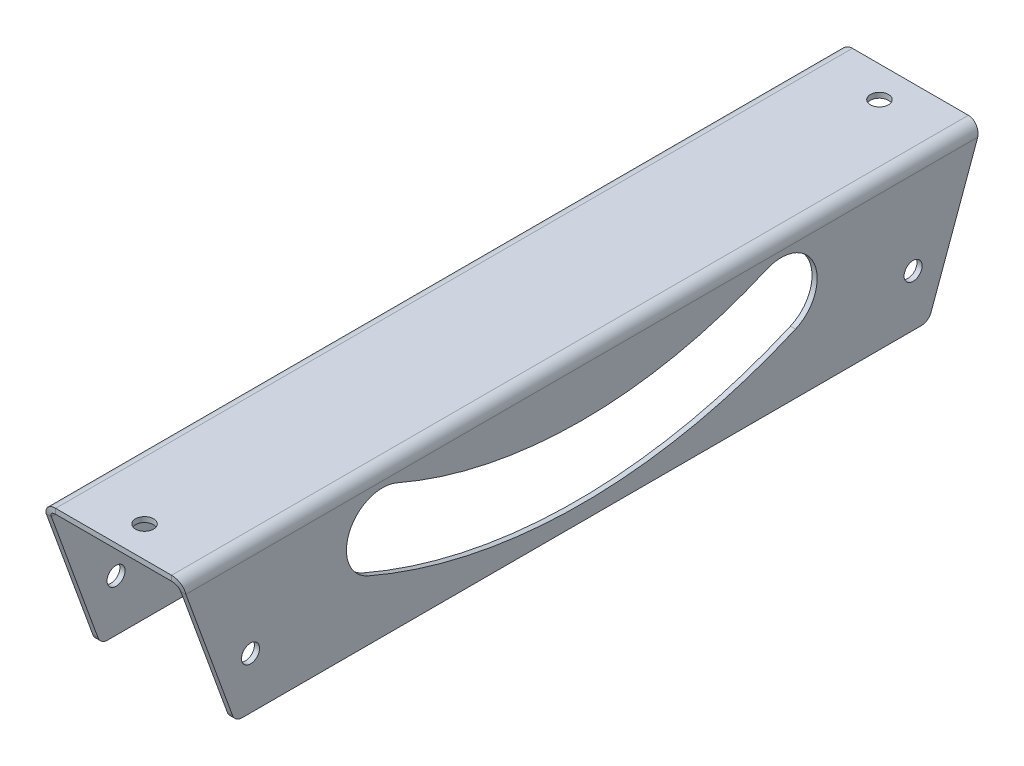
ISO-10303-21;
HEADER;
FILE_DESCRIPTION(('STEP AP214'),'2;1');
FILE_NAME('part.step','',(''),(''),'','','');
FILE_SCHEMA(('AUTOMOTIVE_DESIGN { 1 0 10303 214 1 1 1 1 }'));
ENDSEC;
DATA;
#1=APPLICATION_CONTEXT('core data for automotive mechanical design processes');
#2=APPLICATION_PROTOCOL_DEFINITION('international standard','automotive_design',2000,#1);
#3=PRODUCT_CONTEXT('',#1,'mechanical');
#4=PRODUCT('Part','Part','',(#3));
#5=PRODUCT_RELATED_PRODUCT_CATEGORY('part','',(#4));
#6=PRODUCT_DEFINITION_FORMATION('','',#4);
#7=PRODUCT_DEFINITION_CONTEXT('part definition',#1,'design');
#8=PRODUCT_DEFINITION('design','',#6,#7);
#9=PRODUCT_DEFINITION_SHAPE('','',#8);
#10=(LENGTH_UNIT() NAMED_UNIT(*) SI_UNIT(.MILLI.,.METRE.));
#11=(NAMED_UNIT(*) PLANE_ANGLE_UNIT() SI_UNIT($,.RADIAN.));
#12=(NAMED_UNIT(*) SI_UNIT($,.STERADIAN.) SOLID_ANGLE_UNIT());
#13=UNCERTAINTY_MEASURE_WITH_UNIT(LENGTH_MEASURE(1.E-05),#10,'distance_accuracy_value','');
#14=(GEOMETRIC_REPRESENTATION_CONTEXT(3) GLOBAL_UNCERTAINTY_ASSIGNED_CONTEXT((#13)) GLOBAL_UNIT_ASSIGNED_CONTEXT((#10,
#11,#12)) REPRESENTATION_CONTEXT('',''));
#15=CARTESIAN_POINT('',(0.,0.,0.));
#16=DIRECTION('',(0.,0.,1.));
#17=DIRECTION('',(1.,0.,0.));
#18=AXIS2_PLACEMENT_3D('',#15,#16,#17);
#19=CARTESIAN_POINT('',(25.1,0.,200.));
#20=DIRECTION('',(1.,0.,0.));
#21=DIRECTION('',(0.,1.,0.));
#22=AXIS2_PLACEMENT_3D('',#19,#20,#21);
#23=PLANE('',#22);
#24=CARTESIAN_POINT('',(25.1,-35.,128.581626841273));
#25=DIRECTION('',(1.,0.,0.));
#26=DIRECTION('',(0.,1.,0.));
#27=AXIS2_PLACEMENT_3D('',#24,#25,#26);
#28=CIRCLE('',#27,3.49999999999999);
#29=CARTESIAN_POINT('',(25.1,-38.5,128.581626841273));
#30=VERTEX_POINT('',#29);
#31=EDGE_CURVE('E354',#30,#30,#28,.T.);
#32=ORIENTED_EDGE('',*,*,#31,.T.);
#33=EDGE_LOOP('',(#32));
#34=FACE_BOUND('',#33,.T.);
#35=CARTESIAN_POINT('',(25.1,-35.,-128.581626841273));
#36=DIRECTION('',(1.,0.,0.));
#37=DIRECTION('',(0.,1.,0.));
#38=AXIS2_PLACEMENT_3D('',#35,#36,#37);
#39=CIRCLE('',#38,3.49999999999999);
#40=CARTESIAN_POINT('',(25.1,-38.5,-128.581626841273));
#41=VERTEX_POINT('',#40);
#42=EDGE_CURVE('E208',#41,#41,#39,.T.);
#43=ORIENTED_EDGE('',*,*,#42,.T.);
#44=EDGE_LOOP('',(#43));
#45=FACE_BOUND('',#44,.T.);
#46=CARTESIAN_POINT('',(25.1,159.,0.));
#47=DIRECTION('',(1.,0.,0.));
#48=DIRECTION('',(0.,1.,0.));
#49=AXIS2_PLACEMENT_3D('',#46,#47,#48);
#50=CIRCLE('',#49,208.);
#51=CARTESIAN_POINT('',(25.1,-31.7484954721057,-82.9398063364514));
#52=VERTEX_POINT('',#51);
#53=CARTESIAN_POINT('',(25.1,-31.7484954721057,82.9398063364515));
#54=VERTEX_POINT('',#53);
#55=EDGE_CURVE('E184',#52,#54,#50,.F.);
#56=ORIENTED_EDGE('',*,*,#55,.F.);
#57=CARTESIAN_POINT('',(25.1,-18.9096544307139,-77.357319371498));
#58=DIRECTION('',(1.,0.,0.));
#59=DIRECTION('',(0.,1.,0.));
#60=AXIS2_PLACEMENT_3D('',#57,#58,#59);
#61=CIRCLE('',#60,14.);
#62=CARTESIAN_POINT('',(25.1,-6.07081338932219,-71.7748324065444));
#63=VERTEX_POINT('',#62);
#64=EDGE_CURVE('E191',#63,#52,#61,.F.);
#65=ORIENTED_EDGE('',*,*,#64,.F.);
#66=CARTESIAN_POINT('',(25.1,159.,0.));
#67=DIRECTION('',(1.,0.,0.));
#68=DIRECTION('',(0.,1.,0.));
#69=AXIS2_PLACEMENT_3D('',#66,#67,#68);
#70=CIRCLE('',#69,180.);
#71=CARTESIAN_POINT('',(25.1,-6.07081338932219,71.7748324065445));
#72=VERTEX_POINT('',#71);
#73=EDGE_CURVE('E196',#72,#63,#70,.T.);
#74=ORIENTED_EDGE('',*,*,#73,.F.);
#75=CARTESIAN_POINT('',(25.1,-18.909654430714,77.357319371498));
#76=DIRECTION('',(1.,0.,0.));
#77=DIRECTION('',(0.,1.,0.));
#78=AXIS2_PLACEMENT_3D('',#75,#76,#77);
#79=CIRCLE('',#78,14.);
#80=EDGE_CURVE('E59',#54,#72,#79,.F.);
#81=ORIENTED_EDGE('',*,*,#80,.F.);
#82=EDGE_LOOP('',(#56,#65,#74,#81));
#83=FACE_BOUND('',#82,.T.);
#84=DIRECTION('',(0.,-0.939692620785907,0.342020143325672));
#85=VECTOR('',#84,1.);
#86=CARTESIAN_POINT('',(25.1,-113.973573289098,-113.139819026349));
#87=LINE('',#86,#85);
#88=CARTESIAN_POINT('',(25.1,-2.60000000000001,-153.676484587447));
#89=VERTEX_POINT('',#88);
#90=CARTESIAN_POINT('',(25.1,-52.3680805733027,-135.562384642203));
#91=VERTEX_POINT('',#90);
#92=EDGE_CURVE('E249',#89,#91,#87,.T.);
#93=ORIENTED_EDGE('',*,*,#92,.T.);
#94=CARTESIAN_POINT('',(25.1,-51.,-131.803614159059));
#95=DIRECTION('',(1.,0.,0.));
#96=DIRECTION('',(0.,1.,0.));
#97=AXIS2_PLACEMENT_3D('',#94,#95,#96);
#98=CIRCLE('',#97,4.);
#99=CARTESIAN_POINT('',(25.1,-55.,-131.803614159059));
#100=VERTEX_POINT('',#99);
#101=EDGE_CURVE('E329',#91,#100,#98,.F.);
#102=ORIENTED_EDGE('',*,*,#101,.T.);
#103=DIRECTION('',(0.,0.,-1.));
#104=VECTOR('',#103,1.);
#105=CARTESIAN_POINT('',(25.1,-55.,200.));
#106=LINE('',#105,#104);
#107=CARTESIAN_POINT('',(25.1,-55.,131.803614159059));
#108=VERTEX_POINT('',#107);
#109=EDGE_CURVE('E312',#108,#100,#106,.T.);
#110=ORIENTED_EDGE('',*,*,#109,.F.);
#111=CARTESIAN_POINT('',(25.1,-51.,131.803614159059));
#112=DIRECTION('',(1.,0.,0.));
#113=DIRECTION('',(0.,1.,0.));
#114=AXIS2_PLACEMENT_3D('',#111,#112,#113);
#115=CIRCLE('',#114,4.);
#116=CARTESIAN_POINT('',(25.1,-52.3680805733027,135.562384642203));
#117=VERTEX_POINT('',#116);
#118=EDGE_CURVE('E327',#108,#117,#115,.F.);
#119=ORIENTED_EDGE('',*,*,#118,.T.);
#120=DIRECTION('',(0.,0.939692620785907,0.342020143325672));
#121=VECTOR('',#120,1.);
#122=CARTESIAN_POINT('',(25.1,-55.,134.604444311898));
#123=LINE('',#122,#121);
#124=CARTESIAN_POINT('',(25.1,-2.60000000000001,153.676484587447));
#125=VERTEX_POINT('',#124);
#126=EDGE_CURVE('E239',#117,#125,#123,.T.);
#127=ORIENTED_EDGE('',*,*,#126,.T.);
#128=DIRECTION('',(0.,0.,-1.));
#129=VECTOR('',#128,1.);
#130=CARTESIAN_POINT('',(25.1,-2.60000000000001,200.));
#131=LINE('',#130,#129);
#132=EDGE_CURVE('E285',#125,#89,#131,.T.);
#133=ORIENTED_EDGE('',*,*,#132,.T.);
#134=EDGE_LOOP('',(#93,#102,#110,#119,#127,#133));
#135=FACE_BOUND('',#134,.T.);
#136=ADVANCED_FACE('F42',(#34,#45,#83,#135),#23,.F.);
#137=CARTESIAN_POINT('',(27.1,-55.,200.));
#138=DIRECTION('',(0.,-1.,0.));
#139=DIRECTION('',(0.,0.,-1.));
#140=AXIS2_PLACEMENT_3D('',#137,#138,#139);
#141=PLANE('',#140);
#142=ORIENTED_EDGE('',*,*,#109,.T.);
#143=DIRECTION('',(-1.,0.,0.));
#144=VECTOR('',#143,1.);
#145=CARTESIAN_POINT('',(27.1,-55.,-131.803614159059));
#146=LINE('',#145,#144);
#147=CARTESIAN_POINT('',(27.1,-55.,-131.803614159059));
#148=VERTEX_POINT('',#147);
#149=EDGE_CURVE('E318',#100,#148,#146,.F.);
#150=ORIENTED_EDGE('',*,*,#149,.T.);
#151=DIRECTION('',(0.,0.,-1.));
#152=VECTOR('',#151,1.);
#153=CARTESIAN_POINT('',(27.1,-55.,200.));
#154=LINE('',#153,#152);
#155=CARTESIAN_POINT('',(27.1,-55.,131.803614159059));
#156=VERTEX_POINT('',#155);
#157=EDGE_CURVE('E309',#156,#148,#154,.T.);
#158=ORIENTED_EDGE('',*,*,#157,.F.);
#159=DIRECTION('',(1.,0.,0.));
#160=VECTOR('',#159,1.);
#161=CARTESIAN_POINT('',(27.1,-55.,131.803614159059));
#162=LINE('',#161,#160);
#163=EDGE_CURVE('E315',#156,#108,#162,.F.);
#164=ORIENTED_EDGE('',*,*,#163,.T.);
#165=EDGE_LOOP('',(#142,#150,#158,#164));
#166=FACE_BOUND('',#165,.T.);
#167=ADVANCED_FACE('F408',(#166),#141,.T.);
#168=CARTESIAN_POINT('',(27.1,0.,200.));
#169=DIRECTION('',(1.,0.,0.));
#170=DIRECTION('',(0.,1.,0.));
#171=AXIS2_PLACEMENT_3D('',#168,#169,#170);
#172=PLANE('',#171);
#173=CARTESIAN_POINT('',(27.1,-35.,128.581626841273));
#174=DIRECTION('',(-1.,0.,0.));
#175=DIRECTION('',(0.,1.,0.));
#176=AXIS2_PLACEMENT_3D('',#173,#174,#175);
#177=CIRCLE('',#176,3.49999999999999);
#178=CARTESIAN_POINT('',(27.1,-38.5,128.581626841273));
#179=VERTEX_POINT('',#178);
#180=EDGE_CURVE('E355',#179,#179,#177,.T.);
#181=ORIENTED_EDGE('',*,*,#180,.T.);
#182=EDGE_LOOP('',(#181));
#183=FACE_BOUND('',#182,.T.);
#184=CARTESIAN_POINT('',(27.1,-35.,-128.581626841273));
#185=DIRECTION('',(-1.,0.,0.));
#186=DIRECTION('',(0.,-1.,0.));
#187=AXIS2_PLACEMENT_3D('',#184,#185,#186);
#188=CIRCLE('',#187,3.49999999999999);
#189=CARTESIAN_POINT('',(27.1,-38.5,-128.581626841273));
#190=VERTEX_POINT('',#189);
#191=EDGE_CURVE('E351',#190,#190,#188,.T.);
#192=ORIENTED_EDGE('',*,*,#191,.T.);
#193=EDGE_LOOP('',(#192));
#194=FACE_BOUND('',#193,.T.);
#195=CARTESIAN_POINT('',(27.1,-18.9096544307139,-77.357319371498));
#196=DIRECTION('',(1.,0.,0.));
#197=DIRECTION('',(0.,1.,0.));
#198=AXIS2_PLACEMENT_3D('',#195,#196,#197);
#199=CIRCLE('',#198,14.);
#200=CARTESIAN_POINT('',(27.1,-31.7484954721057,-82.9398063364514));
#201=VERTEX_POINT('',#200);
#202=CARTESIAN_POINT('',(27.1,-6.07081338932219,-71.7748324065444));
#203=VERTEX_POINT('',#202);
#204=EDGE_CURVE('E67',#201,#203,#199,.T.);
#205=ORIENTED_EDGE('',*,*,#204,.F.);
#206=CARTESIAN_POINT('',(27.1,159.,0.));
#207=DIRECTION('',(1.,0.,0.));
#208=DIRECTION('',(0.,1.,0.));
#209=AXIS2_PLACEMENT_3D('',#206,#207,#208);
#210=CIRCLE('',#209,208.);
#211=CARTESIAN_POINT('',(27.1,-31.7484954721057,82.9398063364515));
#212=VERTEX_POINT('',#211);
#213=EDGE_CURVE('E186',#212,#201,#210,.T.);
#214=ORIENTED_EDGE('',*,*,#213,.F.);
#215=CARTESIAN_POINT('',(27.1,-18.909654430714,77.357319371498));
#216=DIRECTION('',(1.,0.,0.));
#217=DIRECTION('',(0.,-1.,0.));
#218=AXIS2_PLACEMENT_3D('',#215,#216,#217);
#219=CIRCLE('',#218,14.);
#220=CARTESIAN_POINT('',(27.1,-6.07081338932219,71.7748324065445));
#221=VERTEX_POINT('',#220);
#222=EDGE_CURVE('E385',#221,#212,#219,.T.);
#223=ORIENTED_EDGE('',*,*,#222,.F.);
#224=CARTESIAN_POINT('',(27.1,159.,0.));
#225=DIRECTION('',(-1.,0.,0.));
#226=DIRECTION('',(0.,1.,0.));
#227=AXIS2_PLACEMENT_3D('',#224,#225,#226);
#228=CIRCLE('',#227,180.);
#229=EDGE_CURVE('E388',#203,#221,#228,.T.);
#230=ORIENTED_EDGE('',*,*,#229,.F.);
#231=EDGE_LOOP('',(#205,#214,#223,#230));
#232=FACE_BOUND('',#231,.T.);
#233=ORIENTED_EDGE('',*,*,#157,.T.);
#234=CARTESIAN_POINT('',(27.1,-51.,-131.803614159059));
#235=DIRECTION('',(1.,0.,0.));
#236=DIRECTION('',(0.,1.,0.));
#237=AXIS2_PLACEMENT_3D('',#234,#235,#236);
#238=CIRCLE('',#237,4.);
#239=CARTESIAN_POINT('',(27.1,-52.3680805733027,-135.562384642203));
#240=VERTEX_POINT('',#239);
#241=EDGE_CURVE('E323',#148,#240,#238,.T.);
#242=ORIENTED_EDGE('',*,*,#241,.T.);
#243=DIRECTION('',(0.,-0.939692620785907,0.342020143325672));
#244=VECTOR('',#243,1.);
#245=CARTESIAN_POINT('',(27.1,-113.973573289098,-113.139819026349));
#246=LINE('',#245,#244);
#247=CARTESIAN_POINT('',(27.1,-2.60000000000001,-153.676484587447));
#248=VERTEX_POINT('',#247);
#249=EDGE_CURVE('E252',#248,#240,#246,.T.);
#250=ORIENTED_EDGE('',*,*,#249,.F.);
#251=DIRECTION('',(0.,0.,-1.));
#252=VECTOR('',#251,1.);
#253=CARTESIAN_POINT('',(27.1,-2.60000000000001,200.));
#254=LINE('',#253,#252);
#255=CARTESIAN_POINT('',(27.1,-2.60000000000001,153.676484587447));
#256=VERTEX_POINT('',#255);
#257=EDGE_CURVE('E307',#256,#248,#254,.T.);
#258=ORIENTED_EDGE('',*,*,#257,.F.);
#259=DIRECTION('',(0.,0.939692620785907,0.342020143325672));
#260=VECTOR('',#259,1.);
#261=CARTESIAN_POINT('',(27.1,-55.,134.604444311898));
#262=LINE('',#261,#260);
#263=CARTESIAN_POINT('',(27.1,-52.3680805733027,135.562384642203));
#264=VERTEX_POINT('',#263);
#265=EDGE_CURVE('E236',#264,#256,#262,.T.);
#266=ORIENTED_EDGE('',*,*,#265,.F.);
#267=CARTESIAN_POINT('',(27.1,-51.,131.803614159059));
#268=DIRECTION('',(1.,0.,0.));
#269=DIRECTION('',(0.,1.,0.));
#270=AXIS2_PLACEMENT_3D('',#267,#268,#269);
#271=CIRCLE('',#270,4.);
#272=EDGE_CURVE('E321',#264,#156,#271,.T.);
#273=ORIENTED_EDGE('',*,*,#272,.T.);
#274=EDGE_LOOP('',(#233,#242,#250,#258,#266,#273));
#275=FACE_BOUND('',#274,.T.);
#276=ADVANCED_FACE('F395',(#183,#194,#232,#275),#172,.T.);
#277=CARTESIAN_POINT('',(22.5,-2.60000000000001,200.));
#278=DIRECTION('',(0.,0.,-1.));
#279=DIRECTION('',(-1.,0.,0.));
#280=AXIS2_PLACEMENT_3D('',#277,#278,#279);
#281=CYLINDRICAL_SURFACE('',#280,4.6);
#282=DIRECTION('',(0.,0.,-1.));
#283=VECTOR('',#282,1.);
#284=CARTESIAN_POINT('',(22.5,1.99999999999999,200.));
#285=LINE('',#284,#283);
#286=CARTESIAN_POINT('',(22.5,1.99999999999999,154.622807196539));
#287=VERTEX_POINT('',#286);
#288=CARTESIAN_POINT('',(22.5,1.99999999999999,-154.622807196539));
#289=VERTEX_POINT('',#288);
#290=EDGE_CURVE('E305',#287,#289,#285,.T.);
#291=ORIENTED_EDGE('',*,*,#290,.F.);
#292=CARTESIAN_POINT('',(22.5,-2.60000000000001,153.676484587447));
#293=DIRECTION('',(0.,0.201502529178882,-0.979487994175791));
#294=DIRECTION('',(0.,-0.979487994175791,-0.201502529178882));
#295=AXIS2_PLACEMENT_3D('',#292,#293,#294);
#296=ELLIPSE('',#295,4.69633117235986,4.6);
#297=EDGE_CURVE('E209',#256,#287,#296,.F.);
#298=ORIENTED_EDGE('',*,*,#297,.F.);
#299=ORIENTED_EDGE('',*,*,#257,.T.);
#300=CARTESIAN_POINT('',(22.5,-2.60000000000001,-153.676484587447));
#301=DIRECTION('',(0.,0.201502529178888,0.97948799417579));
#302=DIRECTION('',(0.,0.97948799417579,-0.201502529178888));
#303=AXIS2_PLACEMENT_3D('',#300,#301,#302);
#304=ELLIPSE('',#303,4.69633117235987,4.6);
#305=EDGE_CURVE('E246',#289,#248,#304,.F.);
#306=ORIENTED_EDGE('',*,*,#305,.F.);
#307=EDGE_LOOP('',(#291,#298,#299,#306));
#308=FACE_BOUND('',#307,.T.);
#309=ADVANCED_FACE('F478',(#308),#281,.T.);
#310=CARTESIAN_POINT('',(25.1,1.99999999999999,200.));
#311=DIRECTION('',(0.,1.,0.));
#312=DIRECTION('',(0.,0.,1.));
#313=AXIS2_PLACEMENT_3D('',#310,#311,#312);
#314=PLANE('',#313);
#315=CARTESIAN_POINT('',(0.,1.99999999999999,142.622807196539));
#316=DIRECTION('',(0.,1.,0.));
#317=DIRECTION('',(0.,0.,-1.));
#318=AXIS2_PLACEMENT_3D('',#315,#316,#317);
#319=CIRCLE('',#318,3.5);
#320=CARTESIAN_POINT('',(0.,1.99999999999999,146.122807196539));
#321=VERTEX_POINT('',#320);
#322=EDGE_CURVE('E369',#321,#321,#319,.T.);
#323=ORIENTED_EDGE('',*,*,#322,.F.);
#324=EDGE_LOOP('',(#323));
#325=FACE_BOUND('',#324,.T.);
#326=CARTESIAN_POINT('',(0.,1.99999999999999,-142.622807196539));
#327=DIRECTION('',(0.,1.,0.));
#328=DIRECTION('',(0.,0.,1.));
#329=AXIS2_PLACEMENT_3D('',#326,#327,#328);
#330=CIRCLE('',#329,3.5);
#331=CARTESIAN_POINT('',(0.,1.99999999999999,-139.122807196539));
#332=VERTEX_POINT('',#331);
#333=EDGE_CURVE('E359',#332,#332,#330,.T.);
#334=ORIENTED_EDGE('',*,*,#333,.F.);
#335=EDGE_LOOP('',(#334));
#336=FACE_BOUND('',#335,.T.);
#337=DIRECTION('',(0.,0.,-1.));
#338=VECTOR('',#337,1.);
#339=CARTESIAN_POINT('',(-22.5,1.99999999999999,200.));
#340=LINE('',#339,#338);
#341=CARTESIAN_POINT('',(-22.5,1.99999999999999,154.622807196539));
#342=VERTEX_POINT('',#341);
#343=CARTESIAN_POINT('',(-22.5,1.99999999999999,-154.622807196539));
#344=VERTEX_POINT('',#343);
#345=EDGE_CURVE('E303',#342,#344,#340,.T.);
#346=ORIENTED_EDGE('',*,*,#345,.F.);
#347=DIRECTION('',(1.,0.,0.));
#348=VECTOR('',#347,1.);
#349=CARTESIAN_POINT('',(25.1,1.99999999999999,154.622807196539));
#350=LINE('',#349,#348);
#351=EDGE_CURVE('E228',#287,#342,#350,.F.);
#352=ORIENTED_EDGE('',*,*,#351,.F.);
#353=ORIENTED_EDGE('',*,*,#290,.T.);
#354=DIRECTION('',(1.,0.,0.));
#355=VECTOR('',#354,1.);
#356=CARTESIAN_POINT('',(25.1,1.99999999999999,-154.622807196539));
#357=LINE('',#356,#355);
#358=EDGE_CURVE('E276',#344,#289,#357,.T.);
#359=ORIENTED_EDGE('',*,*,#358,.F.);
#360=EDGE_LOOP('',(#346,#352,#353,#359));
#361=FACE_BOUND('',#360,.T.);
#362=ADVANCED_FACE('F466',(#325,#336,#361),#314,.T.);
#363=CARTESIAN_POINT('',(-22.5,-2.60000000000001,200.));
#364=DIRECTION('',(0.,0.,-1.));
#365=DIRECTION('',(-1.,0.,0.));
#366=AXIS2_PLACEMENT_3D('',#363,#364,#365);
#367=CYLINDRICAL_SURFACE('',#366,4.6);
#368=DIRECTION('',(0.,0.,-1.));
#369=VECTOR('',#368,1.);
#370=CARTESIAN_POINT('',(-27.1,-2.60000000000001,200.));
#371=LINE('',#370,#369);
#372=CARTESIAN_POINT('',(-27.1,-2.60000000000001,153.676484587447));
#373=VERTEX_POINT('',#372);
#374=CARTESIAN_POINT('',(-27.1,-2.60000000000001,-153.676484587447));
#375=VERTEX_POINT('',#374);
#376=EDGE_CURVE('E301',#373,#375,#371,.T.);
#377=ORIENTED_EDGE('',*,*,#376,.F.);
#378=CARTESIAN_POINT('',(-22.5,-2.60000000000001,153.676484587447));
#379=DIRECTION('',(0.,0.201502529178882,-0.979487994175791));
#380=DIRECTION('',(0.,-0.979487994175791,-0.201502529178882));
#381=AXIS2_PLACEMENT_3D('',#378,#379,#380);
#382=ELLIPSE('',#381,4.69633117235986,4.6);
#383=EDGE_CURVE('E214',#342,#373,#382,.F.);
#384=ORIENTED_EDGE('',*,*,#383,.F.);
#385=ORIENTED_EDGE('',*,*,#345,.T.);
#386=CARTESIAN_POINT('',(-22.5,-2.60000000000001,-153.676484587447));
#387=DIRECTION('',(0.,0.201502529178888,0.97948799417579));
#388=DIRECTION('',(0.,0.97948799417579,-0.201502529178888));
#389=AXIS2_PLACEMENT_3D('',#386,#387,#388);
#390=ELLIPSE('',#389,4.69633117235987,4.6);
#391=EDGE_CURVE('E261',#375,#344,#390,.F.);
#392=ORIENTED_EDGE('',*,*,#391,.F.);
#393=EDGE_LOOP('',(#377,#384,#385,#392));
#394=FACE_BOUND('',#393,.T.);
#395=ADVANCED_FACE('F460',(#394),#367,.T.);
#396=CARTESIAN_POINT('',(-27.1,0.,200.));
#397=DIRECTION('',(-1.,0.,0.));
#398=DIRECTION('',(0.,-1.,0.));
#399=AXIS2_PLACEMENT_3D('',#396,#397,#398);
#400=PLANE('',#399);
#401=CARTESIAN_POINT('',(-27.1,-35.,128.581626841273));
#402=DIRECTION('',(-1.,0.,0.));
#403=DIRECTION('',(0.,1.,0.));
#404=AXIS2_PLACEMENT_3D('',#401,#402,#403);
#405=CIRCLE('',#404,3.49999999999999);
#406=CARTESIAN_POINT('',(-27.1,-38.5,128.581626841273));
#407=VERTEX_POINT('',#406);
#408=EDGE_CURVE('E358',#407,#407,#405,.T.);
#409=ORIENTED_EDGE('',*,*,#408,.F.);
#410=EDGE_LOOP('',(#409));
#411=FACE_BOUND('',#410,.T.);
#412=CARTESIAN_POINT('',(-27.1,-35.,-128.581626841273));
#413=DIRECTION('',(-1.,0.,0.));
#414=DIRECTION('',(0.,-1.,0.));
#415=AXIS2_PLACEMENT_3D('',#412,#413,#414);
#416=CIRCLE('',#415,3.49999999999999);
#417=CARTESIAN_POINT('',(-27.1,-38.5,-128.581626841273));
#418=VERTEX_POINT('',#417);
#419=EDGE_CURVE('E376',#418,#418,#416,.T.);
#420=ORIENTED_EDGE('',*,*,#419,.F.);
#421=EDGE_LOOP('',(#420));
#422=FACE_BOUND('',#421,.T.);
#423=DIRECTION('',(0.,-0.939692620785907,0.342020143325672));
#424=VECTOR('',#423,1.);
#425=CARTESIAN_POINT('',(-27.1,-55.,-134.604444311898));
#426=LINE('',#425,#424);
#427=CARTESIAN_POINT('',(-27.1,-52.3680805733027,-135.562384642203));
#428=VERTEX_POINT('',#427);
#429=EDGE_CURVE('E264',#375,#428,#426,.T.);
#430=ORIENTED_EDGE('',*,*,#429,.T.);
#431=CARTESIAN_POINT('',(-27.1,-51.,-131.803614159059));
#432=DIRECTION('',(-1.,0.,0.));
#433=DIRECTION('',(0.,-1.,0.));
#434=AXIS2_PLACEMENT_3D('',#431,#432,#433);
#435=CIRCLE('',#434,4.);
#436=CARTESIAN_POINT('',(-27.1,-55.,-131.803614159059));
#437=VERTEX_POINT('',#436);
#438=EDGE_CURVE('E345',#428,#437,#435,.T.);
#439=ORIENTED_EDGE('',*,*,#438,.T.);
#440=DIRECTION('',(0.,0.,-1.));
#441=VECTOR('',#440,1.);
#442=CARTESIAN_POINT('',(-27.1,-55.,200.));
#443=LINE('',#442,#441);
#444=CARTESIAN_POINT('',(-27.1,-55.,131.803614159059));
#445=VERTEX_POINT('',#444);
#446=EDGE_CURVE('E298',#445,#437,#443,.T.);
#447=ORIENTED_EDGE('',*,*,#446,.F.);
#448=CARTESIAN_POINT('',(-27.1,-51.,131.803614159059));
#449=DIRECTION('',(-1.,0.,0.));
#450=DIRECTION('',(0.,-1.,0.));
#451=AXIS2_PLACEMENT_3D('',#448,#449,#450);
#452=CIRCLE('',#451,4.);
#453=CARTESIAN_POINT('',(-27.1,-52.3680805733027,135.562384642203));
#454=VERTEX_POINT('',#453);
#455=EDGE_CURVE('E343',#445,#454,#452,.T.);
#456=ORIENTED_EDGE('',*,*,#455,.T.);
#457=DIRECTION('',(0.,-0.939692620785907,-0.342020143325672));
#458=VECTOR('',#457,1.);
#459=CARTESIAN_POINT('',(-27.1,14.583948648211,159.930930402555));
#460=LINE('',#459,#458);
#461=EDGE_CURVE('E219',#373,#454,#460,.T.);
#462=ORIENTED_EDGE('',*,*,#461,.F.);
#463=ORIENTED_EDGE('',*,*,#376,.T.);
#464=EDGE_LOOP('',(#430,#439,#447,#456,#462,#463));
#465=FACE_BOUND('',#464,.T.);
#466=ADVANCED_FACE('F516',(#411,#422,#465),#400,.T.);
#467=CARTESIAN_POINT('',(-25.1,-55.,200.));
#468=DIRECTION('',(0.,-1.,0.));
#469=DIRECTION('',(0.,0.,-1.));
#470=AXIS2_PLACEMENT_3D('',#467,#468,#469);
#471=PLANE('',#470);
#472=ORIENTED_EDGE('',*,*,#446,.T.);
#473=DIRECTION('',(1.,0.,0.));
#474=VECTOR('',#473,1.);
#475=CARTESIAN_POINT('',(-25.1,-55.,-131.803614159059));
#476=LINE('',#475,#474);
#477=CARTESIAN_POINT('',(-25.1,-55.,-131.803614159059));
#478=VERTEX_POINT('',#477);
#479=EDGE_CURVE('E334',#437,#478,#476,.T.);
#480=ORIENTED_EDGE('',*,*,#479,.T.);
#481=DIRECTION('',(0.,0.,-1.));
#482=VECTOR('',#481,1.);
#483=CARTESIAN_POINT('',(-25.1,-55.,200.));
#484=LINE('',#483,#482);
#485=CARTESIAN_POINT('',(-25.1,-55.,131.803614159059));
#486=VERTEX_POINT('',#485);
#487=EDGE_CURVE('E295',#486,#478,#484,.T.);
#488=ORIENTED_EDGE('',*,*,#487,.F.);
#489=DIRECTION('',(1.,0.,0.));
#490=VECTOR('',#489,1.);
#491=CARTESIAN_POINT('',(-25.1,-55.,131.803614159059));
#492=LINE('',#491,#490);
#493=EDGE_CURVE('E331',#486,#445,#492,.F.);
#494=ORIENTED_EDGE('',*,*,#493,.T.);
#495=EDGE_LOOP('',(#472,#480,#488,#494));
#496=FACE_BOUND('',#495,.T.);
#497=ADVANCED_FACE('F443',(#496),#471,.T.);
#498=CARTESIAN_POINT('',(-25.1,0.,200.));
#499=DIRECTION('',(-1.,0.,0.));
#500=DIRECTION('',(0.,-1.,0.));
#501=AXIS2_PLACEMENT_3D('',#498,#499,#500);
#502=PLANE('',#501);
#503=CARTESIAN_POINT('',(-25.1,-35.,128.581626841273));
#504=DIRECTION('',(-1.,0.,0.));
#505=DIRECTION('',(0.,-1.,0.));
#506=AXIS2_PLACEMENT_3D('',#503,#504,#505);
#507=CIRCLE('',#506,3.49999999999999);
#508=CARTESIAN_POINT('',(-25.1,-38.5,128.581626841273));
#509=VERTEX_POINT('',#508);
#510=EDGE_CURVE('E352',#509,#509,#507,.T.);
#511=ORIENTED_EDGE('',*,*,#510,.T.);
#512=EDGE_LOOP('',(#511));
#513=FACE_BOUND('',#512,.T.);
#514=CARTESIAN_POINT('',(-25.1,-35.,-128.581626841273));
#515=DIRECTION('',(-1.,0.,0.));
#516=DIRECTION('',(0.,-1.,0.));
#517=AXIS2_PLACEMENT_3D('',#514,#515,#516);
#518=CIRCLE('',#517,3.49999999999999);
#519=CARTESIAN_POINT('',(-25.1,-38.5,-128.581626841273));
#520=VERTEX_POINT('',#519);
#521=EDGE_CURVE('E348',#520,#520,#518,.T.);
#522=ORIENTED_EDGE('',*,*,#521,.T.);
#523=EDGE_LOOP('',(#522));
#524=FACE_BOUND('',#523,.T.);
#525=ORIENTED_EDGE('',*,*,#487,.T.);
#526=CARTESIAN_POINT('',(-25.1,-51.,-131.803614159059));
#527=DIRECTION('',(-1.,0.,0.));
#528=DIRECTION('',(0.,-1.,0.));
#529=AXIS2_PLACEMENT_3D('',#526,#527,#528);
#530=CIRCLE('',#529,4.);
#531=CARTESIAN_POINT('',(-25.1,-52.3680805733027,-135.562384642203));
#532=VERTEX_POINT('',#531);
#533=EDGE_CURVE('E339',#478,#532,#530,.F.);
#534=ORIENTED_EDGE('',*,*,#533,.T.);
#535=DIRECTION('',(0.,-0.939692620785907,0.342020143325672));
#536=VECTOR('',#535,1.);
#537=CARTESIAN_POINT('',(-25.1,-55.,-134.604444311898));
#538=LINE('',#537,#536);
#539=CARTESIAN_POINT('',(-25.1,-2.60000000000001,-153.676484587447));
#540=VERTEX_POINT('',#539);
#541=EDGE_CURVE('E267',#540,#532,#538,.T.);
#542=ORIENTED_EDGE('',*,*,#541,.F.);
#543=DIRECTION('',(0.,0.,-1.));
#544=VECTOR('',#543,1.);
#545=CARTESIAN_POINT('',(-25.1,-2.60000000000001,200.));
#546=LINE('',#545,#544);
#547=CARTESIAN_POINT('',(-25.1,-2.60000000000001,153.676484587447));
#548=VERTEX_POINT('',#547);
#549=EDGE_CURVE('E293',#548,#540,#546,.T.);
#550=ORIENTED_EDGE('',*,*,#549,.F.);
#551=DIRECTION('',(0.,-0.939692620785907,-0.342020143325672));
#552=VECTOR('',#551,1.);
#553=CARTESIAN_POINT('',(-25.1,14.583948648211,159.930930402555));
#554=LINE('',#553,#552);
#555=CARTESIAN_POINT('',(-25.1,-52.3680805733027,135.562384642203));
#556=VERTEX_POINT('',#555);
#557=EDGE_CURVE('E216',#548,#556,#554,.T.);
#558=ORIENTED_EDGE('',*,*,#557,.T.);
#559=CARTESIAN_POINT('',(-25.1,-51.,131.803614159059));
#560=DIRECTION('',(-1.,0.,0.));
#561=DIRECTION('',(0.,-1.,0.));
#562=AXIS2_PLACEMENT_3D('',#559,#560,#561);
#563=CIRCLE('',#562,4.);
#564=EDGE_CURVE('E337',#556,#486,#563,.F.);
#565=ORIENTED_EDGE('',*,*,#564,.T.);
#566=EDGE_LOOP('',(#525,#534,#542,#550,#558,#565));
#567=FACE_BOUND('',#566,.T.);
#568=ADVANCED_FACE('F439',(#513,#524,#567),#502,.F.);
#569=CARTESIAN_POINT('',(-22.5,-2.60000000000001,200.));
#570=DIRECTION('',(0.,0.,-1.));
#571=DIRECTION('',(-1.,0.,0.));
#572=AXIS2_PLACEMENT_3D('',#569,#570,#571);
#573=CYLINDRICAL_SURFACE('',#572,2.6);
#574=CARTESIAN_POINT('',(-22.5,-2.60000000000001,153.676484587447));
#575=DIRECTION('',(0.,0.342020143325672,-0.939692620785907));
#576=DIRECTION('',(0.,-0.939692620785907,-0.342020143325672));
#577=AXIS2_PLACEMENT_3D('',#574,#575,#576);
#578=ELLIPSE('',#577,2.76686220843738,2.6);
#579=CARTESIAN_POINT('',(-22.5,0.,154.622807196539));
#580=VERTEX_POINT('',#579);
#581=EDGE_CURVE('E211',#580,#548,#578,.F.);
#582=ORIENTED_EDGE('',*,*,#581,.T.);
#583=ORIENTED_EDGE('',*,*,#549,.T.);
#584=CARTESIAN_POINT('',(-22.5,-2.60000000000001,-153.676484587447));
#585=DIRECTION('',(0.,0.342020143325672,0.939692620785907));
#586=DIRECTION('',(0.,0.939692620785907,-0.342020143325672));
#587=AXIS2_PLACEMENT_3D('',#584,#585,#586);
#588=ELLIPSE('',#587,2.76686220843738,2.6);
#589=CARTESIAN_POINT('',(-22.5,0.,-154.622807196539));
#590=VERTEX_POINT('',#589);
#591=EDGE_CURVE('E260',#540,#590,#588,.F.);
#592=ORIENTED_EDGE('',*,*,#591,.T.);
#593=DIRECTION('',(0.,0.,-1.));
#594=VECTOR('',#593,1.);
#595=CARTESIAN_POINT('',(-22.5,0.,200.));
#596=LINE('',#595,#594);
#597=EDGE_CURVE('E291',#580,#590,#596,.T.);
#598=ORIENTED_EDGE('',*,*,#597,.F.);
#599=EDGE_LOOP('',(#582,#583,#592,#598));
#600=FACE_BOUND('',#599,.T.);
#601=ADVANCED_FACE('F508',(#600),#573,.F.);
#602=CARTESIAN_POINT('',(25.1,0.,200.));
#603=DIRECTION('',(0.,1.,0.));
#604=DIRECTION('',(0.,0.,1.));
#605=AXIS2_PLACEMENT_3D('',#602,#603,#604);
#606=PLANE('',#605);
#607=CARTESIAN_POINT('',(0.,0.,142.622807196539));
#608=DIRECTION('',(0.,1.,0.));
#609=DIRECTION('',(0.,0.,1.));
#610=AXIS2_PLACEMENT_3D('',#607,#608,#609);
#611=CIRCLE('',#610,3.5);
#612=CARTESIAN_POINT('',(0.,0.,146.122807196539));
#613=VERTEX_POINT('',#612);
#614=EDGE_CURVE('E46',#613,#613,#611,.T.);
#615=ORIENTED_EDGE('',*,*,#614,.T.);
#616=EDGE_LOOP('',(#615));
#617=FACE_BOUND('',#616,.T.);
#618=CARTESIAN_POINT('',(0.,0.,-142.622807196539));
#619=DIRECTION('',(0.,1.,0.));
#620=DIRECTION('',(0.,0.,1.));
#621=AXIS2_PLACEMENT_3D('',#618,#619,#620);
#622=CIRCLE('',#621,3.5);
#623=CARTESIAN_POINT('',(0.,0.,-139.122807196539));
#624=VERTEX_POINT('',#623);
#625=EDGE_CURVE('E356',#624,#624,#622,.T.);
#626=ORIENTED_EDGE('',*,*,#625,.T.);
#627=EDGE_LOOP('',(#626));
#628=FACE_BOUND('',#627,.T.);
#629=DIRECTION('',(-1.,0.,0.));
#630=VECTOR('',#629,1.);
#631=CARTESIAN_POINT('',(25.1,0.,154.622807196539));
#632=LINE('',#631,#630);
#633=CARTESIAN_POINT('',(22.5,0.,154.622807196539));
#634=VERTEX_POINT('',#633);
#635=EDGE_CURVE('E227',#634,#580,#632,.T.);
#636=ORIENTED_EDGE('',*,*,#635,.T.);
#637=ORIENTED_EDGE('',*,*,#597,.T.);
#638=DIRECTION('',(1.,0.,0.));
#639=VECTOR('',#638,1.);
#640=CARTESIAN_POINT('',(25.1,0.,-154.622807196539));
#641=LINE('',#640,#639);
#642=CARTESIAN_POINT('',(22.5,0.,-154.622807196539));
#643=VERTEX_POINT('',#642);
#644=EDGE_CURVE('E275',#590,#643,#641,.T.);
#645=ORIENTED_EDGE('',*,*,#644,.T.);
#646=DIRECTION('',(0.,0.,-1.));
#647=VECTOR('',#646,1.);
#648=CARTESIAN_POINT('',(22.5,0.,200.));
#649=LINE('',#648,#647);
#650=EDGE_CURVE('E289',#634,#643,#649,.T.);
#651=ORIENTED_EDGE('',*,*,#650,.F.);
#652=EDGE_LOOP('',(#636,#637,#645,#651));
#653=FACE_BOUND('',#652,.T.);
#654=ADVANCED_FACE('F505',(#617,#628,#653),#606,.F.);
#655=CARTESIAN_POINT('',(22.5,-2.60000000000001,200.));
#656=DIRECTION('',(0.,0.,-1.));
#657=DIRECTION('',(-1.,0.,0.));
#658=AXIS2_PLACEMENT_3D('',#655,#656,#657);
#659=CYLINDRICAL_SURFACE('',#658,2.6);
#660=CARTESIAN_POINT('',(22.5,-2.60000000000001,153.676484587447));
#661=DIRECTION('',(0.,0.342020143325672,-0.939692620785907));
#662=DIRECTION('',(0.,-0.939692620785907,-0.342020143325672));
#663=AXIS2_PLACEMENT_3D('',#660,#661,#662);
#664=ELLIPSE('',#663,2.76686220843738,2.6);
#665=EDGE_CURVE('E200',#125,#634,#664,.F.);
#666=ORIENTED_EDGE('',*,*,#665,.T.);
#667=ORIENTED_EDGE('',*,*,#650,.T.);
#668=CARTESIAN_POINT('',(22.5,-2.60000000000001,-153.676484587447));
#669=DIRECTION('',(0.,0.342020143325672,0.939692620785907));
#670=DIRECTION('',(0.,0.939692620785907,-0.342020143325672));
#671=AXIS2_PLACEMENT_3D('',#668,#669,#670);
#672=ELLIPSE('',#671,2.76686220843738,2.6);
#673=EDGE_CURVE('E245',#643,#89,#672,.F.);
#674=ORIENTED_EDGE('',*,*,#673,.T.);
#675=ORIENTED_EDGE('',*,*,#132,.F.);
#676=EDGE_LOOP('',(#666,#667,#674,#675));
#677=FACE_BOUND('',#676,.T.);
#678=ADVANCED_FACE('F502',(#677),#659,.F.);
#679=CARTESIAN_POINT('',(25.1,0.,-154.622807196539));
#680=DIRECTION('',(0.,0.,1.));
#681=DIRECTION('',(1.,0.,0.));
#682=AXIS2_PLACEMENT_3D('',#679,#680,#681);
#683=PLANE('',#682);
#684=DIRECTION('',(0.,-1.,0.));
#685=VECTOR('',#684,1.);
#686=CARTESIAN_POINT('',(22.5,0.,-154.622807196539));
#687=LINE('',#686,#685);
#688=EDGE_CURVE('E282',#643,#289,#687,.F.);
#689=ORIENTED_EDGE('',*,*,#688,.F.);
#690=ORIENTED_EDGE('',*,*,#644,.F.);
#691=DIRECTION('',(0.,-1.,0.));
#692=VECTOR('',#691,1.);
#693=CARTESIAN_POINT('',(-22.5,0.,-154.622807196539));
#694=LINE('',#693,#692);
#695=EDGE_CURVE('E279',#590,#344,#694,.F.);
#696=ORIENTED_EDGE('',*,*,#695,.T.);
#697=ORIENTED_EDGE('',*,*,#358,.T.);
#698=EDGE_LOOP('',(#689,#690,#696,#697));
#699=FACE_BOUND('',#698,.T.);
#700=ADVANCED_FACE('F470',(#699),#683,.F.);
#701=CARTESIAN_POINT('',(-27.1,-55.,-134.604444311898));
#702=DIRECTION('',(0.,-0.342020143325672,-0.939692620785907));
#703=DIRECTION('',(0.,-0.939692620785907,0.342020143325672));
#704=AXIS2_PLACEMENT_3D('',#701,#702,#703);
#705=PLANE('',#704);
#706=ORIENTED_EDGE('',*,*,#541,.T.);
#707=DIRECTION('',(1.,0.,0.));
#708=VECTOR('',#707,1.);
#709=CARTESIAN_POINT('',(-27.1,-52.3680805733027,-135.562384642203));
#710=LINE('',#709,#708);
#711=EDGE_CURVE('E341',#532,#428,#710,.F.);
#712=ORIENTED_EDGE('',*,*,#711,.T.);
#713=ORIENTED_EDGE('',*,*,#429,.F.);
#714=DIRECTION('',(-1.,0.,0.));
#715=VECTOR('',#714,1.);
#716=CARTESIAN_POINT('',(-27.1,-2.60000000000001,-153.676484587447));
#717=LINE('',#716,#715);
#718=EDGE_CURVE('E270',#375,#540,#717,.F.);
#719=ORIENTED_EDGE('',*,*,#718,.T.);
#720=EDGE_LOOP('',(#706,#712,#713,#719));
#721=FACE_BOUND('',#720,.T.);
#722=ADVANCED_FACE('F450',(#721),#705,.T.);
#723=CARTESIAN_POINT('',(-22.5,1.99999999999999,-154.622807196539));
#724=CARTESIAN_POINT('',(-22.5,1.33333333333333,-154.622807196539));
#725=CARTESIAN_POINT('',(-22.5,0.666666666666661,-154.622807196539));
#726=CARTESIAN_POINT('',(-22.5,0.,-154.622807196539));
#727=CARTESIAN_POINT('',(-13.3,1.99999999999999,-154.622807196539));
#728=CARTESIAN_POINT('',(-14.6333333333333,1.33333333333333,-154.622807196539));
#729=CARTESIAN_POINT('',(-15.9666666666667,0.666666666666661,-154.622807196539));
#730=CARTESIAN_POINT('',(-17.3,0.,-154.622807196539));
#731=CARTESIAN_POINT('',(-13.3,-7.20000000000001,-152.730161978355));
#732=CARTESIAN_POINT('',(-14.6333333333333,-6.53333333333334,-152.730161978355));
#733=CARTESIAN_POINT('',(-15.9666666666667,-5.86666666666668,-152.730161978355));
#734=CARTESIAN_POINT('',(-17.3,-5.20000000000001,-152.730161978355));
#735=CARTESIAN_POINT('',(-22.5,-7.20000000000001,-152.730161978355));
#736=CARTESIAN_POINT('',(-22.5,-6.53333333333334,-152.730161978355));
#737=CARTESIAN_POINT('',(-22.5,-5.86666666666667,-152.730161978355));
#738=CARTESIAN_POINT('',(-22.5,-5.20000000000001,-152.730161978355));
#739=CARTESIAN_POINT('',(-31.7,-7.2,-152.730161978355));
#740=CARTESIAN_POINT('',(-30.3666666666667,-6.53333333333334,-152.730161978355));
#741=CARTESIAN_POINT('',(-29.0333333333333,-5.86666666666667,-152.730161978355));
#742=CARTESIAN_POINT('',(-27.7,-5.2,-152.730161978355));
#743=CARTESIAN_POINT('',(-31.7,1.99999999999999,-154.622807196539));
#744=CARTESIAN_POINT('',(-30.3666666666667,1.33333333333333,-154.622807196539));
#745=CARTESIAN_POINT('',(-29.0333333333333,0.666666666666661,-154.622807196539));
#746=CARTESIAN_POINT('',(-27.7,0.,-154.622807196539));
#747=CARTESIAN_POINT('',(-22.5,1.99999999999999,-154.622807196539));
#748=CARTESIAN_POINT('',(-22.5,1.33333333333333,-154.622807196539));
#749=CARTESIAN_POINT('',(-22.5,0.666666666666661,-154.622807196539));
#750=CARTESIAN_POINT('',(-22.5,0.,-154.622807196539));
#751=(BOUNDED_SURFACE() B_SPLINE_SURFACE(3,3,((#723,#724,#725,#726),(#727,#728,#729,#730),(#731,
#732,#733,#734),(#735,#736,#737,#738),(#739,#740,#741,#742),(#743,#744,#745,#746),(#747,#748,
#749,#750)),.UNSPECIFIED.,.T.,.F.,.F.) B_SPLINE_SURFACE_WITH_KNOTS((4,3,4),(4,4),(0.,0.5,1.),
(0.,1.),.UNSPECIFIED.) GEOMETRIC_REPRESENTATION_ITEM() RATIONAL_B_SPLINE_SURFACE(((1.,1.,1.,1.),
(0.333333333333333,0.333333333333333,0.333333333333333,0.333333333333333),(0.333333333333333,
0.333333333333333,0.333333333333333,0.333333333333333),(1.,1.,1.,1.),(0.333333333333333,
0.333333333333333,0.333333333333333,0.333333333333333),(0.333333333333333,0.333333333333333,
0.333333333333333,0.333333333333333),(1.,1.,1.,1.))) REPRESENTATION_ITEM('') SURFACE());
#752=ORIENTED_EDGE('',*,*,#695,.F.);
#753=ORIENTED_EDGE('',*,*,#591,.F.);
#754=ORIENTED_EDGE('',*,*,#718,.F.);
#755=ORIENTED_EDGE('',*,*,#391,.T.);
#756=EDGE_LOOP('',(#752,#753,#754,#755));
#757=FACE_BOUND('',#756,.T.);
#758=ADVANCED_FACE('F457',(#757),#751,.T.);
#759=CARTESIAN_POINT('',(25.1,-113.973573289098,-113.139819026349));
#760=DIRECTION('',(0.,0.342020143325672,0.939692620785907));
#761=DIRECTION('',(0.,-0.939692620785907,0.342020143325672));
#762=AXIS2_PLACEMENT_3D('',#759,#760,#761);
#763=PLANE('',#762);
#764=ORIENTED_EDGE('',*,*,#249,.T.);
#765=DIRECTION('',(1.,0.,0.));
#766=VECTOR('',#765,1.);
#767=CARTESIAN_POINT('',(25.1,-52.3680805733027,-135.562384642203));
#768=LINE('',#767,#766);
#769=EDGE_CURVE('E325',#240,#91,#768,.F.);
#770=ORIENTED_EDGE('',*,*,#769,.T.);
#771=ORIENTED_EDGE('',*,*,#92,.F.);
#772=DIRECTION('',(-1.,0.,0.));
#773=VECTOR('',#772,1.);
#774=CARTESIAN_POINT('',(25.1,-2.60000000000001,-153.676484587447));
#775=LINE('',#774,#773);
#776=EDGE_CURVE('E255',#89,#248,#775,.F.);
#777=ORIENTED_EDGE('',*,*,#776,.T.);
#778=EDGE_LOOP('',(#764,#770,#771,#777));
#779=FACE_BOUND('',#778,.T.);
#780=ADVANCED_FACE('F486',(#779),#763,.F.);
#781=CARTESIAN_POINT('',(22.5,1.99999999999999,-154.622807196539));
#782=CARTESIAN_POINT('',(22.5,1.33333333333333,-154.622807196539));
#783=CARTESIAN_POINT('',(22.5,0.666666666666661,-154.622807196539));
#784=CARTESIAN_POINT('',(22.5,0.,-154.622807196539));
#785=CARTESIAN_POINT('',(31.7,1.99999999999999,-154.622807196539));
#786=CARTESIAN_POINT('',(30.3666666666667,1.33333333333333,-154.622807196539));
#787=CARTESIAN_POINT('',(29.0333333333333,0.666666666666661,-154.622807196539));
#788=CARTESIAN_POINT('',(27.7,0.,-154.622807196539));
#789=CARTESIAN_POINT('',(31.7,-7.20000000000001,-152.730161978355));
#790=CARTESIAN_POINT('',(30.3666666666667,-6.53333333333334,-152.730161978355));
#791=CARTESIAN_POINT('',(29.0333333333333,-5.86666666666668,-152.730161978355));
#792=CARTESIAN_POINT('',(27.7,-5.20000000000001,-152.730161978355));
#793=CARTESIAN_POINT('',(22.5,-7.20000000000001,-152.730161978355));
#794=CARTESIAN_POINT('',(22.5,-6.53333333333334,-152.730161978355));
#795=CARTESIAN_POINT('',(22.5,-5.86666666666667,-152.730161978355));
#796=CARTESIAN_POINT('',(22.5,-5.20000000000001,-152.730161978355));
#797=CARTESIAN_POINT('',(13.3,-7.2,-152.730161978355));
#798=CARTESIAN_POINT('',(14.6333333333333,-6.53333333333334,-152.730161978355));
#799=CARTESIAN_POINT('',(15.9666666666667,-5.86666666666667,-152.730161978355));
#800=CARTESIAN_POINT('',(17.3,-5.2,-152.730161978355));
#801=CARTESIAN_POINT('',(13.3,1.99999999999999,-154.622807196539));
#802=CARTESIAN_POINT('',(14.6333333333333,1.33333333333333,-154.622807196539));
#803=CARTESIAN_POINT('',(15.9666666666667,0.666666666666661,-154.622807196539));
#804=CARTESIAN_POINT('',(17.3,0.,-154.622807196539));
#805=CARTESIAN_POINT('',(22.5,1.99999999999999,-154.622807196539));
#806=CARTESIAN_POINT('',(22.5,1.33333333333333,-154.622807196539));
#807=CARTESIAN_POINT('',(22.5,0.666666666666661,-154.622807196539));
#808=CARTESIAN_POINT('',(22.5,0.,-154.622807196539));
#809=(BOUNDED_SURFACE() B_SPLINE_SURFACE(3,3,((#781,#782,#783,#784),(#785,#786,#787,#788),(#789,
#790,#791,#792),(#793,#794,#795,#796),(#797,#798,#799,#800),(#801,#802,#803,#804),(#805,#806,
#807,#808)),.UNSPECIFIED.,.T.,.F.,.F.) B_SPLINE_SURFACE_WITH_KNOTS((4,3,4),(4,4),(0.,0.5,1.),
(0.,1.),.UNSPECIFIED.) GEOMETRIC_REPRESENTATION_ITEM() RATIONAL_B_SPLINE_SURFACE(((1.,1.,1.,1.),
(0.333333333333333,0.333333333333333,0.333333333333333,0.333333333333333),(0.333333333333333,
0.333333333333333,0.333333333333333,0.333333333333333),(1.,1.,1.,1.),(0.333333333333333,
0.333333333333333,0.333333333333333,0.333333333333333),(0.333333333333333,0.333333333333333,
0.333333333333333,0.333333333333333),(1.,1.,1.,1.))) REPRESENTATION_ITEM('') SURFACE());
#810=ORIENTED_EDGE('',*,*,#776,.F.);
#811=ORIENTED_EDGE('',*,*,#673,.F.);
#812=ORIENTED_EDGE('',*,*,#688,.T.);
#813=ORIENTED_EDGE('',*,*,#305,.T.);
#814=EDGE_LOOP('',(#810,#811,#812,#813));
#815=FACE_BOUND('',#814,.T.);
#816=ADVANCED_FACE('F476',(#815),#809,.T.);
#817=CARTESIAN_POINT('',(27.1,-55.,134.604444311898));
#818=DIRECTION('',(0.,0.342020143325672,-0.939692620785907));
#819=DIRECTION('',(0.,0.939692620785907,0.342020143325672));
#820=AXIS2_PLACEMENT_3D('',#817,#818,#819);
#821=PLANE('',#820);
#822=ORIENTED_EDGE('',*,*,#126,.F.);
#823=DIRECTION('',(-1.,0.,0.));
#824=VECTOR('',#823,1.);
#825=CARTESIAN_POINT('',(27.1,-52.3680805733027,135.562384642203));
#826=LINE('',#825,#824);
#827=EDGE_CURVE('E11',#117,#264,#826,.F.);
#828=ORIENTED_EDGE('',*,*,#827,.T.);
#829=ORIENTED_EDGE('',*,*,#265,.T.);
#830=DIRECTION('',(1.,0.,0.));
#831=VECTOR('',#830,1.);
#832=CARTESIAN_POINT('',(27.1,-2.60000000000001,153.676484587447));
#833=LINE('',#832,#831);
#834=EDGE_CURVE('E241',#256,#125,#833,.F.);
#835=ORIENTED_EDGE('',*,*,#834,.T.);
#836=EDGE_LOOP('',(#822,#828,#829,#835));
#837=FACE_BOUND('',#836,.T.);
#838=ADVANCED_FACE('F497',(#837),#821,.F.);
#839=CARTESIAN_POINT('',(25.1,0.,154.622807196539));
#840=DIRECTION('',(0.,0.,-1.));
#841=DIRECTION('',(-1.,0.,0.));
#842=AXIS2_PLACEMENT_3D('',#839,#840,#841);
#843=PLANE('',#842);
#844=DIRECTION('',(0.,-1.,0.));
#845=VECTOR('',#844,1.);
#846=CARTESIAN_POINT('',(-22.5,0.,154.622807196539));
#847=LINE('',#846,#845);
#848=EDGE_CURVE('E233',#580,#342,#847,.F.);
#849=ORIENTED_EDGE('',*,*,#848,.F.);
#850=ORIENTED_EDGE('',*,*,#635,.F.);
#851=DIRECTION('',(0.,-1.,0.));
#852=VECTOR('',#851,1.);
#853=CARTESIAN_POINT('',(22.5,0.,154.622807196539));
#854=LINE('',#853,#852);
#855=EDGE_CURVE('E230',#634,#287,#854,.F.);
#856=ORIENTED_EDGE('',*,*,#855,.T.);
#857=ORIENTED_EDGE('',*,*,#351,.T.);
#858=EDGE_LOOP('',(#849,#850,#856,#857));
#859=FACE_BOUND('',#858,.T.);
#860=ADVANCED_FACE('F648',(#859),#843,.F.);
#861=CARTESIAN_POINT('',(-25.1,14.583948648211,159.930930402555));
#862=DIRECTION('',(0.,0.342020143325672,-0.939692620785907));
#863=DIRECTION('',(0.,-0.939692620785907,-0.342020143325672));
#864=AXIS2_PLACEMENT_3D('',#861,#862,#863);
#865=PLANE('',#864);
#866=ORIENTED_EDGE('',*,*,#461,.T.);
#867=DIRECTION('',(-1.,0.,0.));
#868=VECTOR('',#867,1.);
#869=CARTESIAN_POINT('',(-25.1,-52.3680805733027,135.562384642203));
#870=LINE('',#869,#868);
#871=EDGE_CURVE('E51',#454,#556,#870,.F.);
#872=ORIENTED_EDGE('',*,*,#871,.T.);
#873=ORIENTED_EDGE('',*,*,#557,.F.);
#874=DIRECTION('',(1.,0.,0.));
#875=VECTOR('',#874,1.);
#876=CARTESIAN_POINT('',(-25.1,-2.60000000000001,153.676484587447));
#877=LINE('',#876,#875);
#878=EDGE_CURVE('E222',#548,#373,#877,.F.);
#879=ORIENTED_EDGE('',*,*,#878,.T.);
#880=EDGE_LOOP('',(#866,#872,#873,#879));
#881=FACE_BOUND('',#880,.T.);
#882=ADVANCED_FACE('F514',(#881),#865,.F.);
#883=CARTESIAN_POINT('',(-22.5,-7.20000000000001,152.730161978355));
#884=CARTESIAN_POINT('',(-22.5,-6.53333333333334,152.730161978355));
#885=CARTESIAN_POINT('',(-22.5,-5.86666666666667,152.730161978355));
#886=CARTESIAN_POINT('',(-22.5,-5.20000000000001,152.730161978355));
#887=CARTESIAN_POINT('',(-13.3,-7.20000000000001,152.730161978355));
#888=CARTESIAN_POINT('',(-14.6333333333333,-6.53333333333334,152.730161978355));
#889=CARTESIAN_POINT('',(-15.9666666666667,-5.86666666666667,152.730161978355));
#890=CARTESIAN_POINT('',(-17.3,-5.20000000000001,152.730161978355));
#891=CARTESIAN_POINT('',(-13.3,1.99999999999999,154.622807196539));
#892=CARTESIAN_POINT('',(-14.6333333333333,1.33333333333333,154.622807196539));
#893=CARTESIAN_POINT('',(-15.9666666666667,0.666666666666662,154.622807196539));
#894=CARTESIAN_POINT('',(-17.3,0.,154.622807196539));
#895=CARTESIAN_POINT('',(-22.5,1.99999999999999,154.622807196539));
#896=CARTESIAN_POINT('',(-22.5,1.33333333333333,154.622807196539));
#897=CARTESIAN_POINT('',(-22.5,0.666666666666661,154.622807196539));
#898=CARTESIAN_POINT('',(-22.5,0.,154.622807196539));
#899=CARTESIAN_POINT('',(-31.7,1.99999999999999,154.622807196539));
#900=CARTESIAN_POINT('',(-30.3666666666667,1.33333333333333,154.622807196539));
#901=CARTESIAN_POINT('',(-29.0333333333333,0.66666666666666,154.622807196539));
#902=CARTESIAN_POINT('',(-27.7,0.,154.622807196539));
#903=CARTESIAN_POINT('',(-31.7,-7.20000000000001,152.730161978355));
#904=CARTESIAN_POINT('',(-30.3666666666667,-6.53333333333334,152.730161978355));
#905=CARTESIAN_POINT('',(-29.0333333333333,-5.86666666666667,152.730161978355));
#906=CARTESIAN_POINT('',(-27.7,-5.20000000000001,152.730161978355));
#907=CARTESIAN_POINT('',(-22.5,-7.20000000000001,152.730161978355));
#908=CARTESIAN_POINT('',(-22.5,-6.53333333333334,152.730161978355));
#909=CARTESIAN_POINT('',(-22.5,-5.86666666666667,152.730161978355));
#910=CARTESIAN_POINT('',(-22.5,-5.20000000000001,152.730161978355));
#911=(BOUNDED_SURFACE() B_SPLINE_SURFACE(3,3,((#883,#884,#885,#886),(#887,#888,#889,#890),(#891,
#892,#893,#894),(#895,#896,#897,#898),(#899,#900,#901,#902),(#903,#904,#905,#906),(#907,#908,
#909,#910)),.UNSPECIFIED.,.T.,.F.,.F.) B_SPLINE_SURFACE_WITH_KNOTS((4,3,4),(4,4),(0.,0.5,1.),
(0.,1.),.UNSPECIFIED.) GEOMETRIC_REPRESENTATION_ITEM() RATIONAL_B_SPLINE_SURFACE(((1.,1.,1.,1.),
(0.333333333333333,0.333333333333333,0.333333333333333,0.333333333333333),(0.333333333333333,
0.333333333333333,0.333333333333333,0.333333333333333),(1.,1.,1.,1.),(0.333333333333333,
0.333333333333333,0.333333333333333,0.333333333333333),(0.333333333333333,0.333333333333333,
0.333333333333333,0.333333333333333),(1.,1.,1.,1.))) REPRESENTATION_ITEM('') SURFACE());
#912=ORIENTED_EDGE('',*,*,#878,.F.);
#913=ORIENTED_EDGE('',*,*,#581,.F.);
#914=ORIENTED_EDGE('',*,*,#848,.T.);
#915=ORIENTED_EDGE('',*,*,#383,.T.);
#916=EDGE_LOOP('',(#912,#913,#914,#915));
#917=FACE_BOUND('',#916,.T.);
#918=ADVANCED_FACE('F511',(#917),#911,.T.);
#919=CARTESIAN_POINT('',(22.5,-7.20000000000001,152.730161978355));
#920=CARTESIAN_POINT('',(22.5,-6.53333333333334,152.730161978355));
#921=CARTESIAN_POINT('',(22.5,-5.86666666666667,152.730161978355));
#922=CARTESIAN_POINT('',(22.5,-5.20000000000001,152.730161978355));
#923=CARTESIAN_POINT('',(31.7,-7.20000000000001,152.730161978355));
#924=CARTESIAN_POINT('',(30.3666666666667,-6.53333333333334,152.730161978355));
#925=CARTESIAN_POINT('',(29.0333333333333,-5.86666666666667,152.730161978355));
#926=CARTESIAN_POINT('',(27.7,-5.20000000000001,152.730161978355));
#927=CARTESIAN_POINT('',(31.7,1.99999999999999,154.622807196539));
#928=CARTESIAN_POINT('',(30.3666666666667,1.33333333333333,154.622807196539));
#929=CARTESIAN_POINT('',(29.0333333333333,0.666666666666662,154.622807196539));
#930=CARTESIAN_POINT('',(27.7,0.,154.622807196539));
#931=CARTESIAN_POINT('',(22.5,1.99999999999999,154.622807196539));
#932=CARTESIAN_POINT('',(22.5,1.33333333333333,154.622807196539));
#933=CARTESIAN_POINT('',(22.5,0.666666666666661,154.622807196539));
#934=CARTESIAN_POINT('',(22.5,0.,154.622807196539));
#935=CARTESIAN_POINT('',(13.3,1.99999999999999,154.622807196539));
#936=CARTESIAN_POINT('',(14.6333333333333,1.33333333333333,154.622807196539));
#937=CARTESIAN_POINT('',(15.9666666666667,0.66666666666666,154.622807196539));
#938=CARTESIAN_POINT('',(17.3,0.,154.622807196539));
#939=CARTESIAN_POINT('',(13.3,-7.20000000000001,152.730161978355));
#940=CARTESIAN_POINT('',(14.6333333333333,-6.53333333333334,152.730161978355));
#941=CARTESIAN_POINT('',(15.9666666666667,-5.86666666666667,152.730161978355));
#942=CARTESIAN_POINT('',(17.3,-5.20000000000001,152.730161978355));
#943=CARTESIAN_POINT('',(22.5,-7.20000000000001,152.730161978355));
#944=CARTESIAN_POINT('',(22.5,-6.53333333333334,152.730161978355));
#945=CARTESIAN_POINT('',(22.5,-5.86666666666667,152.730161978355));
#946=CARTESIAN_POINT('',(22.5,-5.20000000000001,152.730161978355));
#947=(BOUNDED_SURFACE() B_SPLINE_SURFACE(3,3,((#919,#920,#921,#922),(#923,#924,#925,#926),(#927,
#928,#929,#930),(#931,#932,#933,#934),(#935,#936,#937,#938),(#939,#940,#941,#942),(#943,#944,
#945,#946)),.UNSPECIFIED.,.T.,.F.,.F.) B_SPLINE_SURFACE_WITH_KNOTS((4,3,4),(4,4),(0.,0.5,1.),
(0.,1.),.UNSPECIFIED.) GEOMETRIC_REPRESENTATION_ITEM() RATIONAL_B_SPLINE_SURFACE(((1.,1.,1.,1.),
(0.333333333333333,0.333333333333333,0.333333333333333,0.333333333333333),(0.333333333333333,
0.333333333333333,0.333333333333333,0.333333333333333),(1.,1.,1.,1.),(0.333333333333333,
0.333333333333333,0.333333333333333,0.333333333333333),(0.333333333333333,0.333333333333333,
0.333333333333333,0.333333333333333),(1.,1.,1.,1.))) REPRESENTATION_ITEM('') SURFACE());
#948=ORIENTED_EDGE('',*,*,#855,.F.);
#949=ORIENTED_EDGE('',*,*,#665,.F.);
#950=ORIENTED_EDGE('',*,*,#834,.F.);
#951=ORIENTED_EDGE('',*,*,#297,.T.);
#952=EDGE_LOOP('',(#948,#949,#950,#951));
#953=FACE_BOUND('',#952,.T.);
#954=ADVANCED_FACE('F423',(#953),#947,.T.);
#955=CARTESIAN_POINT('',(27.1,-51.,-131.803614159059));
#956=DIRECTION('',(-1.,0.,0.));
#957=DIRECTION('',(0.,0.,1.));
#958=AXIS2_PLACEMENT_3D('',#955,#956,#957);
#959=CYLINDRICAL_SURFACE('',#958,4.);
#960=ORIENTED_EDGE('',*,*,#101,.F.);
#961=ORIENTED_EDGE('',*,*,#769,.F.);
#962=ORIENTED_EDGE('',*,*,#241,.F.);
#963=ORIENTED_EDGE('',*,*,#149,.F.);
#964=EDGE_LOOP('',(#960,#961,#962,#963));
#965=FACE_BOUND('',#964,.T.);
#966=ADVANCED_FACE('F419',(#965),#959,.T.);
#967=CARTESIAN_POINT('',(-25.1,-51.,-131.803614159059));
#968=DIRECTION('',(1.,0.,0.));
#969=DIRECTION('',(0.,0.,-1.));
#970=AXIS2_PLACEMENT_3D('',#967,#968,#969);
#971=CYLINDRICAL_SURFACE('',#970,4.);
#972=ORIENTED_EDGE('',*,*,#438,.F.);
#973=ORIENTED_EDGE('',*,*,#711,.F.);
#974=ORIENTED_EDGE('',*,*,#533,.F.);
#975=ORIENTED_EDGE('',*,*,#479,.F.);
#976=EDGE_LOOP('',(#972,#973,#974,#975));
#977=FACE_BOUND('',#976,.T.);
#978=ADVANCED_FACE('F422',(#977),#971,.T.);
#979=CARTESIAN_POINT('',(-25.1,-51.,131.803614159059));
#980=DIRECTION('',(1.,0.,0.));
#981=DIRECTION('',(0.,0.,-1.));
#982=AXIS2_PLACEMENT_3D('',#979,#980,#981);
#983=CYLINDRICAL_SURFACE('',#982,4.);
#984=ORIENTED_EDGE('',*,*,#564,.F.);
#985=ORIENTED_EDGE('',*,*,#871,.F.);
#986=ORIENTED_EDGE('',*,*,#455,.F.);
#987=ORIENTED_EDGE('',*,*,#493,.F.);
#988=EDGE_LOOP('',(#984,#985,#986,#987));
#989=FACE_BOUND('',#988,.T.);
#990=ADVANCED_FACE('F426',(#989),#983,.T.);
#991=CARTESIAN_POINT('',(27.1,-51.,131.803614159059));
#992=DIRECTION('',(1.,0.,0.));
#993=DIRECTION('',(0.,0.,-1.));
#994=AXIS2_PLACEMENT_3D('',#991,#992,#993);
#995=CYLINDRICAL_SURFACE('',#994,4.);
#996=ORIENTED_EDGE('',*,*,#272,.F.);
#997=ORIENTED_EDGE('',*,*,#827,.F.);
#998=ORIENTED_EDGE('',*,*,#118,.F.);
#999=ORIENTED_EDGE('',*,*,#163,.F.);
#1000=EDGE_LOOP('',(#996,#997,#998,#999));
#1001=FACE_BOUND('',#1000,.T.);
#1002=ADVANCED_FACE('F44',(#1001),#995,.T.);
#1003=CARTESIAN_POINT('',(-27.101,-18.9096544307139,-77.357319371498));
#1004=DIRECTION('',(1.,0.,0.));
#1005=DIRECTION('',(0.,1.,0.));
#1006=AXIS2_PLACEMENT_3D('',#1003,#1004,#1005);
#1007=CYLINDRICAL_SURFACE('',#1006,14.);
#1008=ORIENTED_EDGE('',*,*,#64,.T.);
#1009=DIRECTION('',(1.,0.,0.));
#1010=VECTOR('',#1009,1.);
#1011=CARTESIAN_POINT('',(-27.101,-31.7484954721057,-82.9398063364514));
#1012=LINE('',#1011,#1010);
#1013=EDGE_CURVE('E180',#52,#201,#1012,.T.);
#1014=ORIENTED_EDGE('',*,*,#1013,.T.);
#1015=ORIENTED_EDGE('',*,*,#204,.T.);
#1016=DIRECTION('',(1.,0.,0.));
#1017=VECTOR('',#1016,1.);
#1018=CARTESIAN_POINT('',(-27.101,-6.07081338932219,-71.7748324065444));
#1019=LINE('',#1018,#1017);
#1020=EDGE_CURVE('E188',#63,#203,#1019,.T.);
#1021=ORIENTED_EDGE('',*,*,#1020,.F.);
#1022=EDGE_LOOP('',(#1008,#1014,#1015,#1021));
#1023=FACE_BOUND('',#1022,.T.);
#1024=ADVANCED_FACE('F192',(#1023),#1007,.F.);
#1025=CARTESIAN_POINT('',(-27.101,159.,0.));
#1026=DIRECTION('',(1.,0.,0.));
#1027=DIRECTION('',(0.,1.,0.));
#1028=AXIS2_PLACEMENT_3D('',#1025,#1026,#1027);
#1029=CYLINDRICAL_SURFACE('',#1028,208.);
#1030=ORIENTED_EDGE('',*,*,#55,.T.);
#1031=DIRECTION('',(1.,0.,0.));
#1032=VECTOR('',#1031,1.);
#1033=CARTESIAN_POINT('',(-27.101,-31.7484954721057,82.9398063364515));
#1034=LINE('',#1033,#1032);
#1035=EDGE_CURVE('E187',#54,#212,#1034,.T.);
#1036=ORIENTED_EDGE('',*,*,#1035,.T.);
#1037=ORIENTED_EDGE('',*,*,#213,.T.);
#1038=ORIENTED_EDGE('',*,*,#1013,.F.);
#1039=EDGE_LOOP('',(#1030,#1036,#1037,#1038));
#1040=FACE_BOUND('',#1039,.T.);
#1041=ADVANCED_FACE('F182',(#1040),#1029,.F.);
#1042=CARTESIAN_POINT('',(-27.101,-18.9096544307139,77.357319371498));
#1043=DIRECTION('',(1.,0.,0.));
#1044=DIRECTION('',(0.,1.,0.));
#1045=AXIS2_PLACEMENT_3D('',#1042,#1043,#1044);
#1046=CYLINDRICAL_SURFACE('',#1045,14.);
#1047=ORIENTED_EDGE('',*,*,#80,.T.);
#1048=DIRECTION('',(1.,0.,0.));
#1049=VECTOR('',#1048,1.);
#1050=CARTESIAN_POINT('',(-27.101,-6.07081338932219,71.7748324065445));
#1051=LINE('',#1050,#1049);
#1052=EDGE_CURVE('E205',#72,#221,#1051,.T.);
#1053=ORIENTED_EDGE('',*,*,#1052,.T.);
#1054=ORIENTED_EDGE('',*,*,#222,.T.);
#1055=ORIENTED_EDGE('',*,*,#1035,.F.);
#1056=EDGE_LOOP('',(#1047,#1053,#1054,#1055));
#1057=FACE_BOUND('',#1056,.T.);
#1058=ADVANCED_FACE('F397',(#1057),#1046,.F.);
#1059=CARTESIAN_POINT('',(-27.101,159.,0.));
#1060=DIRECTION('',(1.,0.,0.));
#1061=DIRECTION('',(0.,1.,0.));
#1062=AXIS2_PLACEMENT_3D('',#1059,#1060,#1061);
#1063=CYLINDRICAL_SURFACE('',#1062,180.);
#1064=ORIENTED_EDGE('',*,*,#73,.T.);
#1065=ORIENTED_EDGE('',*,*,#1020,.T.);
#1066=ORIENTED_EDGE('',*,*,#229,.T.);
#1067=ORIENTED_EDGE('',*,*,#1052,.F.);
#1068=EDGE_LOOP('',(#1064,#1065,#1066,#1067));
#1069=FACE_BOUND('',#1068,.T.);
#1070=ADVANCED_FACE('F393',(#1069),#1063,.T.);
#1071=CARTESIAN_POINT('',(27.1,-35.,-128.581626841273));
#1072=DIRECTION('',(-1.,0.,0.));
#1073=DIRECTION('',(0.,-1.,0.));
#1074=AXIS2_PLACEMENT_3D('',#1071,#1072,#1073);
#1075=CYLINDRICAL_SURFACE('',#1074,3.49999999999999);
#1076=CARTESIAN_POINT('',(-27.1,-38.5,-128.581626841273));
#1077=CARTESIAN_POINT('',(-27.0791666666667,-38.5,-128.581626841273));
#1078=CARTESIAN_POINT('',(-27.0583333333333,-38.5,-128.581626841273));
#1079=CARTESIAN_POINT('',(-27.0166666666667,-38.5,-128.581626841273));
#1080=CARTESIAN_POINT('',(-26.9958333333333,-38.5,-128.581626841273));
#1081=CARTESIAN_POINT('',(-26.9541666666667,-38.5,-128.581626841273));
#1082=CARTESIAN_POINT('',(-26.9333333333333,-38.5,-128.581626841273));
#1083=CARTESIAN_POINT('',(-26.8916666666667,-38.5,-128.581626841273));
#1084=CARTESIAN_POINT('',(-26.8708333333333,-38.5,-128.581626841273));
#1085=CARTESIAN_POINT('',(-26.8291666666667,-38.5,-128.581626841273));
#1086=CARTESIAN_POINT('',(-26.8083333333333,-38.5,-128.581626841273));
#1087=CARTESIAN_POINT('',(-26.7666666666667,-38.5,-128.581626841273));
#1088=CARTESIAN_POINT('',(-26.7458333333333,-38.5,-128.581626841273));
#1089=CARTESIAN_POINT('',(-26.7041666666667,-38.5,-128.581626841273));
#1090=CARTESIAN_POINT('',(-26.6833333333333,-38.5,-128.581626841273));
#1091=CARTESIAN_POINT('',(-26.6416666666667,-38.5,-128.581626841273));
#1092=CARTESIAN_POINT('',(-26.6208333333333,-38.5,-128.581626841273));
#1093=CARTESIAN_POINT('',(-26.5791666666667,-38.5,-128.581626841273));
#1094=CARTESIAN_POINT('',(-26.5583333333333,-38.5,-128.581626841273));
#1095=CARTESIAN_POINT('',(-26.5166666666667,-38.5,-128.581626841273));
#1096=CARTESIAN_POINT('',(-26.4958333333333,-38.5,-128.581626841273));
#1097=CARTESIAN_POINT('',(-26.4541666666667,-38.5,-128.581626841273));
#1098=CARTESIAN_POINT('',(-26.4333333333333,-38.5,-128.581626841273));
#1099=CARTESIAN_POINT('',(-26.3916666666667,-38.5,-128.581626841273));
#1100=CARTESIAN_POINT('',(-26.3708333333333,-38.5,-128.581626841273));
#1101=CARTESIAN_POINT('',(-26.3291666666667,-38.5,-128.581626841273));
#1102=CARTESIAN_POINT('',(-26.3083333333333,-38.5,-128.581626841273));
#1103=CARTESIAN_POINT('',(-26.2666666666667,-38.5,-128.581626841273));
#1104=CARTESIAN_POINT('',(-26.2458333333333,-38.5,-128.581626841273));
#1105=CARTESIAN_POINT('',(-26.2041666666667,-38.5,-128.581626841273));
#1106=CARTESIAN_POINT('',(-26.1833333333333,-38.5,-128.581626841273));
#1107=CARTESIAN_POINT('',(-26.1416666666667,-38.5,-128.581626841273));
#1108=CARTESIAN_POINT('',(-26.1208333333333,-38.5,-128.581626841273));
#1109=CARTESIAN_POINT('',(-26.0791666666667,-38.5,-128.581626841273));
#1110=CARTESIAN_POINT('',(-26.0583333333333,-38.5,-128.581626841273));
#1111=CARTESIAN_POINT('',(-26.0166666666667,-38.5,-128.581626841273));
#1112=CARTESIAN_POINT('',(-25.9958333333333,-38.5,-128.581626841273));
#1113=CARTESIAN_POINT('',(-25.9541666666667,-38.5,-128.581626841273));
#1114=CARTESIAN_POINT('',(-25.9333333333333,-38.5,-128.581626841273));
#1115=CARTESIAN_POINT('',(-25.8916666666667,-38.5,-128.581626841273));
#1116=CARTESIAN_POINT('',(-25.8708333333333,-38.5,-128.581626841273));
#1117=CARTESIAN_POINT('',(-25.8291666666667,-38.5,-128.581626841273));
#1118=CARTESIAN_POINT('',(-25.8083333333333,-38.5,-128.581626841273));
#1119=CARTESIAN_POINT('',(-25.7666666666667,-38.5,-128.581626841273));
#1120=CARTESIAN_POINT('',(-25.7458333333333,-38.5,-128.581626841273));
#1121=CARTESIAN_POINT('',(-25.7041666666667,-38.5,-128.581626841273));
#1122=CARTESIAN_POINT('',(-25.6833333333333,-38.5,-128.581626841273));
#1123=CARTESIAN_POINT('',(-25.6416666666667,-38.5,-128.581626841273));
#1124=CARTESIAN_POINT('',(-25.6208333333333,-38.5,-128.581626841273));
#1125=CARTESIAN_POINT('',(-25.5791666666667,-38.5,-128.581626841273));
#1126=CARTESIAN_POINT('',(-25.5583333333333,-38.5,-128.581626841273));
#1127=CARTESIAN_POINT('',(-25.5166666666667,-38.5,-128.581626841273));
#1128=CARTESIAN_POINT('',(-25.4958333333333,-38.5,-128.581626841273));
#1129=CARTESIAN_POINT('',(-25.4541666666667,-38.5,-128.581626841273));
#1130=CARTESIAN_POINT('',(-25.4333333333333,-38.5,-128.581626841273));
#1131=CARTESIAN_POINT('',(-25.3916666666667,-38.5,-128.581626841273));
#1132=CARTESIAN_POINT('',(-25.3708333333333,-38.5,-128.581626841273));
#1133=CARTESIAN_POINT('',(-25.3291666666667,-38.5,-128.581626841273));
#1134=CARTESIAN_POINT('',(-25.3083333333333,-38.5,-128.581626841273));
#1135=CARTESIAN_POINT('',(-25.2666666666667,-38.5,-128.581626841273));
#1136=CARTESIAN_POINT('',(-25.2458333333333,-38.5,-128.581626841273));
#1137=CARTESIAN_POINT('',(-25.2041666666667,-38.5,-128.581626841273));
#1138=CARTESIAN_POINT('',(-25.1833333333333,-38.5,-128.581626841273));
#1139=CARTESIAN_POINT('',(-25.1416666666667,-38.5,-128.581626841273));
#1140=CARTESIAN_POINT('',(-25.1208333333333,-38.5,-128.581626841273));
#1141=CARTESIAN_POINT('',(-25.1,-38.5,-128.581626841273));
#1142=B_SPLINE_CURVE_WITH_KNOTS('',3,(#1076,#1077,#1078,#1079,#1080,#1081,#1082,#1083,#1084,
#1085,#1086,#1087,#1088,#1089,#1090,#1091,#1092,#1093,#1094,#1095,#1096,#1097,#1098,#1099,#1100,
#1101,#1102,#1103,#1104,#1105,#1106,#1107,#1108,#1109,#1110,#1111,#1112,#1113,#1114,#1115,#1116,
#1117,#1118,#1119,#1120,#1121,#1122,#1123,#1124,#1125,#1126,#1127,#1128,#1129,#1130,#1131,#1132,
#1133,#1134,#1135,#1136,#1137,#1138,#1139,#1140,#1141),.UNSPECIFIED.,.F.,.F.,(4,2,2,2,2,2,2,2,2,
2,2,2,2,2,2,2,2,2,2,2,2,2,2,2,2,2,2,2,2,2,2,2,4),(0.,0.0625000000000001,0.125,0.1875,0.25,
0.3125,0.375,0.4375,0.5,0.5625,0.625000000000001,0.687500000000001,0.750000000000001,
0.812500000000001,0.875000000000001,0.937500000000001,1.,1.0625,1.125,1.1875,1.25,1.3125,1.375,
1.4375,1.5,1.5625,1.625,1.6875,1.75,1.8125,1.875,1.9375,2.),.UNSPECIFIED.);
#1143=EDGE_CURVE('BSEAM404',#418,#520,#1142,.T.);
#1144=ORIENTED_EDGE('',*,*,#419,.T.);
#1145=ORIENTED_EDGE('',*,*,#521,.F.);
#1146=ORIENTED_EDGE('',*,*,#1143,.T.);
#1147=ORIENTED_EDGE('',*,*,#1143,.F.);
#1148=EDGE_LOOP('',(#1144,#1146,#1145,#1147));
#1149=FACE_BOUND('',#1148,.T.);
#1150=ADVANCED_FACE('F404',(#1149),#1075,.F.);
#1151=CARTESIAN_POINT('',(27.1,-38.5,-128.581626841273));
#1152=CARTESIAN_POINT('',(27.0791666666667,-38.5,-128.581626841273));
#1153=CARTESIAN_POINT('',(27.0583333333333,-38.5,-128.581626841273));
#1154=CARTESIAN_POINT('',(27.0166666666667,-38.5,-128.581626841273));
#1155=CARTESIAN_POINT('',(26.9958333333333,-38.5,-128.581626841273));
#1156=CARTESIAN_POINT('',(26.9541666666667,-38.5,-128.581626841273));
#1157=CARTESIAN_POINT('',(26.9333333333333,-38.5,-128.581626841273));
#1158=CARTESIAN_POINT('',(26.8916666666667,-38.5,-128.581626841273));
#1159=CARTESIAN_POINT('',(26.8708333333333,-38.5,-128.581626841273));
#1160=CARTESIAN_POINT('',(26.8291666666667,-38.5,-128.581626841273));
#1161=CARTESIAN_POINT('',(26.8083333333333,-38.5,-128.581626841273));
#1162=CARTESIAN_POINT('',(26.7666666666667,-38.5,-128.581626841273));
#1163=CARTESIAN_POINT('',(26.7458333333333,-38.5,-128.581626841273));
#1164=CARTESIAN_POINT('',(26.7041666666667,-38.5,-128.581626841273));
#1165=CARTESIAN_POINT('',(26.6833333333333,-38.5,-128.581626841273));
#1166=CARTESIAN_POINT('',(26.6416666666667,-38.5,-128.581626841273));
#1167=CARTESIAN_POINT('',(26.6208333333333,-38.5,-128.581626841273));
#1168=CARTESIAN_POINT('',(26.5791666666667,-38.5,-128.581626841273));
#1169=CARTESIAN_POINT('',(26.5583333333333,-38.5,-128.581626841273));
#1170=CARTESIAN_POINT('',(26.5166666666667,-38.5,-128.581626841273));
#1171=CARTESIAN_POINT('',(26.4958333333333,-38.5,-128.581626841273));
#1172=CARTESIAN_POINT('',(26.4541666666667,-38.5,-128.581626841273));
#1173=CARTESIAN_POINT('',(26.4333333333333,-38.5,-128.581626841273));
#1174=CARTESIAN_POINT('',(26.3916666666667,-38.5,-128.581626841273));
#1175=CARTESIAN_POINT('',(26.3708333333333,-38.5,-128.581626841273));
#1176=CARTESIAN_POINT('',(26.3291666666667,-38.5,-128.581626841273));
#1177=CARTESIAN_POINT('',(26.3083333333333,-38.5,-128.581626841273));
#1178=CARTESIAN_POINT('',(26.2666666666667,-38.5,-128.581626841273));
#1179=CARTESIAN_POINT('',(26.2458333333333,-38.5,-128.581626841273));
#1180=CARTESIAN_POINT('',(26.2041666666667,-38.5,-128.581626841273));
#1181=CARTESIAN_POINT('',(26.1833333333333,-38.5,-128.581626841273));
#1182=CARTESIAN_POINT('',(26.1416666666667,-38.5,-128.581626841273));
#1183=CARTESIAN_POINT('',(26.1208333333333,-38.5,-128.581626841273));
#1184=CARTESIAN_POINT('',(26.0791666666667,-38.5,-128.581626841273));
#1185=CARTESIAN_POINT('',(26.0583333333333,-38.5,-128.581626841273));
#1186=CARTESIAN_POINT('',(26.0166666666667,-38.5,-128.581626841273));
#1187=CARTESIAN_POINT('',(25.9958333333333,-38.5,-128.581626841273));
#1188=CARTESIAN_POINT('',(25.9541666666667,-38.5,-128.581626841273));
#1189=CARTESIAN_POINT('',(25.9333333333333,-38.5,-128.581626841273));
#1190=CARTESIAN_POINT('',(25.8916666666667,-38.5,-128.581626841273));
#1191=CARTESIAN_POINT('',(25.8708333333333,-38.5,-128.581626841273));
#1192=CARTESIAN_POINT('',(25.8291666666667,-38.5,-128.581626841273));
#1193=CARTESIAN_POINT('',(25.8083333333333,-38.5,-128.581626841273));
#1194=CARTESIAN_POINT('',(25.7666666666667,-38.5,-128.581626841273));
#1195=CARTESIAN_POINT('',(25.7458333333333,-38.5,-128.581626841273));
#1196=CARTESIAN_POINT('',(25.7041666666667,-38.5,-128.581626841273));
#1197=CARTESIAN_POINT('',(25.6833333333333,-38.5,-128.581626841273));
#1198=CARTESIAN_POINT('',(25.6416666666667,-38.5,-128.581626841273));
#1199=CARTESIAN_POINT('',(25.6208333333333,-38.5,-128.581626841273));
#1200=CARTESIAN_POINT('',(25.5791666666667,-38.5,-128.581626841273));
#1201=CARTESIAN_POINT('',(25.5583333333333,-38.5,-128.581626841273));
#1202=CARTESIAN_POINT('',(25.5166666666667,-38.5,-128.581626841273));
#1203=CARTESIAN_POINT('',(25.4958333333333,-38.5,-128.581626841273));
#1204=CARTESIAN_POINT('',(25.4541666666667,-38.5,-128.581626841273));
#1205=CARTESIAN_POINT('',(25.4333333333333,-38.5,-128.581626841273));
#1206=CARTESIAN_POINT('',(25.3916666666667,-38.5,-128.581626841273));
#1207=CARTESIAN_POINT('',(25.3708333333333,-38.5,-128.581626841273));
#1208=CARTESIAN_POINT('',(25.3291666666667,-38.5,-128.581626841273));
#1209=CARTESIAN_POINT('',(25.3083333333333,-38.5,-128.581626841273));
#1210=CARTESIAN_POINT('',(25.2666666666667,-38.5,-128.581626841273));
#1211=CARTESIAN_POINT('',(25.2458333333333,-38.5,-128.581626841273));
#1212=CARTESIAN_POINT('',(25.2041666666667,-38.5,-128.581626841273));
#1213=CARTESIAN_POINT('',(25.1833333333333,-38.5,-128.581626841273));
#1214=CARTESIAN_POINT('',(25.1416666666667,-38.5,-128.581626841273));
#1215=CARTESIAN_POINT('',(25.1208333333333,-38.5,-128.581626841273));
#1216=CARTESIAN_POINT('',(25.1,-38.5,-128.581626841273));
#1217=B_SPLINE_CURVE_WITH_KNOTS('',3,(#1151,#1152,#1153,#1154,#1155,#1156,#1157,#1158,#1159,
#1160,#1161,#1162,#1163,#1164,#1165,#1166,#1167,#1168,#1169,#1170,#1171,#1172,#1173,#1174,#1175,
#1176,#1177,#1178,#1179,#1180,#1181,#1182,#1183,#1184,#1185,#1186,#1187,#1188,#1189,#1190,#1191,
#1192,#1193,#1194,#1195,#1196,#1197,#1198,#1199,#1200,#1201,#1202,#1203,#1204,#1205,#1206,#1207,
#1208,#1209,#1210,#1211,#1212,#1213,#1214,#1215,#1216),.UNSPECIFIED.,.F.,.F.,(4,2,2,2,2,2,2,2,2,
2,2,2,2,2,2,2,2,2,2,2,2,2,2,2,2,2,2,2,2,2,2,2,4),(0.,0.0625000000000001,0.125,0.1875,0.25,
0.3125,0.375,0.4375,0.500000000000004,0.562500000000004,0.625000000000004,0.687500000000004,
0.750000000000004,0.812500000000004,0.875000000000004,0.937500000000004,1.00000000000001,
1.06250000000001,1.12500000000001,1.18750000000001,1.25000000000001,1.31250000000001,
1.37500000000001,1.43750000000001,1.50000000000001,1.56250000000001,1.62500000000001,
1.68750000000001,1.75000000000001,1.81250000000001,1.87500000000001,1.93750000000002,
2.00000000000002),.UNSPECIFIED.);
#1218=EDGE_CURVE('BSEAM542',#190,#41,#1217,.T.);
#1219=ORIENTED_EDGE('',*,*,#191,.F.);
#1220=ORIENTED_EDGE('',*,*,#42,.F.);
#1221=ORIENTED_EDGE('',*,*,#1218,.T.);
#1222=ORIENTED_EDGE('',*,*,#1218,.F.);
#1223=EDGE_LOOP('',(#1219,#1221,#1220,#1222));
#1224=FACE_BOUND('',#1223,.T.);
#1225=ADVANCED_FACE('F542',(#1224),#1075,.F.);
#1226=CARTESIAN_POINT('',(27.1,-35.,128.581626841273));
#1227=DIRECTION('',(-1.,0.,0.));
#1228=DIRECTION('',(0.,-1.,0.));
#1229=AXIS2_PLACEMENT_3D('',#1226,#1227,#1228);
#1230=CYLINDRICAL_SURFACE('',#1229,3.49999999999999);
#1231=CARTESIAN_POINT('',(-27.1,-38.5,128.581626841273));
#1232=CARTESIAN_POINT('',(-27.0791666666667,-38.5,128.581626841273));
#1233=CARTESIAN_POINT('',(-27.0583333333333,-38.5,128.581626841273));
#1234=CARTESIAN_POINT('',(-27.0166666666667,-38.5,128.581626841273));
#1235=CARTESIAN_POINT('',(-26.9958333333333,-38.5,128.581626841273));
#1236=CARTESIAN_POINT('',(-26.9541666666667,-38.5,128.581626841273));
#1237=CARTESIAN_POINT('',(-26.9333333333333,-38.5,128.581626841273));
#1238=CARTESIAN_POINT('',(-26.8916666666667,-38.5,128.581626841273));
#1239=CARTESIAN_POINT('',(-26.8708333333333,-38.5,128.581626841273));
#1240=CARTESIAN_POINT('',(-26.8291666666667,-38.5,128.581626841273));
#1241=CARTESIAN_POINT('',(-26.8083333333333,-38.5,128.581626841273));
#1242=CARTESIAN_POINT('',(-26.7666666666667,-38.5,128.581626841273));
#1243=CARTESIAN_POINT('',(-26.7458333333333,-38.5,128.581626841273));
#1244=CARTESIAN_POINT('',(-26.7041666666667,-38.5,128.581626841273));
#1245=CARTESIAN_POINT('',(-26.6833333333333,-38.5,128.581626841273));
#1246=CARTESIAN_POINT('',(-26.6416666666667,-38.5,128.581626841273));
#1247=CARTESIAN_POINT('',(-26.6208333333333,-38.5,128.581626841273));
#1248=CARTESIAN_POINT('',(-26.5791666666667,-38.5,128.581626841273));
#1249=CARTESIAN_POINT('',(-26.5583333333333,-38.5,128.581626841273));
#1250=CARTESIAN_POINT('',(-26.5166666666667,-38.5,128.581626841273));
#1251=CARTESIAN_POINT('',(-26.4958333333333,-38.5,128.581626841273));
#1252=CARTESIAN_POINT('',(-26.4541666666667,-38.5,128.581626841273));
#1253=CARTESIAN_POINT('',(-26.4333333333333,-38.5,128.581626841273));
#1254=CARTESIAN_POINT('',(-26.3916666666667,-38.5,128.581626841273));
#1255=CARTESIAN_POINT('',(-26.3708333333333,-38.5,128.581626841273));
#1256=CARTESIAN_POINT('',(-26.3291666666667,-38.5,128.581626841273));
#1257=CARTESIAN_POINT('',(-26.3083333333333,-38.5,128.581626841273));
#1258=CARTESIAN_POINT('',(-26.2666666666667,-38.5,128.581626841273));
#1259=CARTESIAN_POINT('',(-26.2458333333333,-38.5,128.581626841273));
#1260=CARTESIAN_POINT('',(-26.2041666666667,-38.5,128.581626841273));
#1261=CARTESIAN_POINT('',(-26.1833333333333,-38.5,128.581626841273));
#1262=CARTESIAN_POINT('',(-26.1416666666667,-38.5,128.581626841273));
#1263=CARTESIAN_POINT('',(-26.1208333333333,-38.5,128.581626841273));
#1264=CARTESIAN_POINT('',(-26.0791666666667,-38.5,128.581626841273));
#1265=CARTESIAN_POINT('',(-26.0583333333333,-38.5,128.581626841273));
#1266=CARTESIAN_POINT('',(-26.0166666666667,-38.5,128.581626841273));
#1267=CARTESIAN_POINT('',(-25.9958333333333,-38.5,128.581626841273));
#1268=CARTESIAN_POINT('',(-25.9541666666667,-38.5,128.581626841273));
#1269=CARTESIAN_POINT('',(-25.9333333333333,-38.5,128.581626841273));
#1270=CARTESIAN_POINT('',(-25.8916666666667,-38.5,128.581626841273));
#1271=CARTESIAN_POINT('',(-25.8708333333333,-38.5,128.581626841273));
#1272=CARTESIAN_POINT('',(-25.8291666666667,-38.5,128.581626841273));
#1273=CARTESIAN_POINT('',(-25.8083333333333,-38.5,128.581626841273));
#1274=CARTESIAN_POINT('',(-25.7666666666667,-38.5,128.581626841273));
#1275=CARTESIAN_POINT('',(-25.7458333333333,-38.5,128.581626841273));
#1276=CARTESIAN_POINT('',(-25.7041666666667,-38.5,128.581626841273));
#1277=CARTESIAN_POINT('',(-25.6833333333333,-38.5,128.581626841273));
#1278=CARTESIAN_POINT('',(-25.6416666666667,-38.5,128.581626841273));
#1279=CARTESIAN_POINT('',(-25.6208333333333,-38.5,128.581626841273));
#1280=CARTESIAN_POINT('',(-25.5791666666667,-38.5,128.581626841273));
#1281=CARTESIAN_POINT('',(-25.5583333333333,-38.5,128.581626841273));
#1282=CARTESIAN_POINT('',(-25.5166666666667,-38.5,128.581626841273));
#1283=CARTESIAN_POINT('',(-25.4958333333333,-38.5,128.581626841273));
#1284=CARTESIAN_POINT('',(-25.4541666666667,-38.5,128.581626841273));
#1285=CARTESIAN_POINT('',(-25.4333333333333,-38.5,128.581626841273));
#1286=CARTESIAN_POINT('',(-25.3916666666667,-38.5,128.581626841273));
#1287=CARTESIAN_POINT('',(-25.3708333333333,-38.5,128.581626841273));
#1288=CARTESIAN_POINT('',(-25.3291666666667,-38.5,128.581626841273));
#1289=CARTESIAN_POINT('',(-25.3083333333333,-38.5,128.581626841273));
#1290=CARTESIAN_POINT('',(-25.2666666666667,-38.5,128.581626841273));
#1291=CARTESIAN_POINT('',(-25.2458333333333,-38.5,128.581626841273));
#1292=CARTESIAN_POINT('',(-25.2041666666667,-38.5,128.581626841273));
#1293=CARTESIAN_POINT('',(-25.1833333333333,-38.5,128.581626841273));
#1294=CARTESIAN_POINT('',(-25.1416666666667,-38.5,128.581626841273));
#1295=CARTESIAN_POINT('',(-25.1208333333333,-38.5,128.581626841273));
#1296=CARTESIAN_POINT('',(-25.1,-38.5,128.581626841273));
#1297=B_SPLINE_CURVE_WITH_KNOTS('',3,(#1231,#1232,#1233,#1234,#1235,#1236,#1237,#1238,#1239,
#1240,#1241,#1242,#1243,#1244,#1245,#1246,#1247,#1248,#1249,#1250,#1251,#1252,#1253,#1254,#1255,
#1256,#1257,#1258,#1259,#1260,#1261,#1262,#1263,#1264,#1265,#1266,#1267,#1268,#1269,#1270,#1271,
#1272,#1273,#1274,#1275,#1276,#1277,#1278,#1279,#1280,#1281,#1282,#1283,#1284,#1285,#1286,#1287,
#1288,#1289,#1290,#1291,#1292,#1293,#1294,#1295,#1296),.UNSPECIFIED.,.F.,.F.,(4,2,2,2,2,2,2,2,2,
2,2,2,2,2,2,2,2,2,2,2,2,2,2,2,2,2,2,2,2,2,2,2,4),(0.,0.0625000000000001,0.125,0.1875,0.25,
0.3125,0.375,0.4375,0.5,0.5625,0.625000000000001,0.687500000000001,0.750000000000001,
0.812500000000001,0.875000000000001,0.937500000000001,1.,1.0625,1.125,1.1875,1.25,1.3125,1.375,
1.4375,1.5,1.5625,1.625,1.6875,1.75,1.8125,1.875,1.9375,2.),.UNSPECIFIED.);
#1298=EDGE_CURVE('BSEAM545',#407,#509,#1297,.T.);
#1299=ORIENTED_EDGE('',*,*,#408,.T.);
#1300=ORIENTED_EDGE('',*,*,#510,.F.);
#1301=ORIENTED_EDGE('',*,*,#1298,.T.);
#1302=ORIENTED_EDGE('',*,*,#1298,.F.);
#1303=EDGE_LOOP('',(#1299,#1301,#1300,#1302));
#1304=FACE_BOUND('',#1303,.T.);
#1305=ADVANCED_FACE('F545',(#1304),#1230,.F.);
#1306=CARTESIAN_POINT('',(27.1,-38.5,128.581626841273));
#1307=CARTESIAN_POINT('',(27.0791666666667,-38.5,128.581626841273));
#1308=CARTESIAN_POINT('',(27.0583333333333,-38.5,128.581626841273));
#1309=CARTESIAN_POINT('',(27.0166666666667,-38.5,128.581626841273));
#1310=CARTESIAN_POINT('',(26.9958333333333,-38.5,128.581626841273));
#1311=CARTESIAN_POINT('',(26.9541666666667,-38.5,128.581626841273));
#1312=CARTESIAN_POINT('',(26.9333333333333,-38.5,128.581626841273));
#1313=CARTESIAN_POINT('',(26.8916666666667,-38.5,128.581626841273));
#1314=CARTESIAN_POINT('',(26.8708333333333,-38.5,128.581626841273));
#1315=CARTESIAN_POINT('',(26.8291666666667,-38.5,128.581626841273));
#1316=CARTESIAN_POINT('',(26.8083333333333,-38.5,128.581626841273));
#1317=CARTESIAN_POINT('',(26.7666666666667,-38.5,128.581626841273));
#1318=CARTESIAN_POINT('',(26.7458333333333,-38.5,128.581626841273));
#1319=CARTESIAN_POINT('',(26.7041666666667,-38.5,128.581626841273));
#1320=CARTESIAN_POINT('',(26.6833333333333,-38.5,128.581626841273));
#1321=CARTESIAN_POINT('',(26.6416666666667,-38.5,128.581626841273));
#1322=CARTESIAN_POINT('',(26.6208333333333,-38.5,128.581626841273));
#1323=CARTESIAN_POINT('',(26.5791666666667,-38.5,128.581626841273));
#1324=CARTESIAN_POINT('',(26.5583333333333,-38.5,128.581626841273));
#1325=CARTESIAN_POINT('',(26.5166666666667,-38.5,128.581626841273));
#1326=CARTESIAN_POINT('',(26.4958333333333,-38.5,128.581626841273));
#1327=CARTESIAN_POINT('',(26.4541666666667,-38.5,128.581626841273));
#1328=CARTESIAN_POINT('',(26.4333333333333,-38.5,128.581626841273));
#1329=CARTESIAN_POINT('',(26.3916666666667,-38.5,128.581626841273));
#1330=CARTESIAN_POINT('',(26.3708333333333,-38.5,128.581626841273));
#1331=CARTESIAN_POINT('',(26.3291666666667,-38.5,128.581626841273));
#1332=CARTESIAN_POINT('',(26.3083333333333,-38.5,128.581626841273));
#1333=CARTESIAN_POINT('',(26.2666666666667,-38.5,128.581626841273));
#1334=CARTESIAN_POINT('',(26.2458333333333,-38.5,128.581626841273));
#1335=CARTESIAN_POINT('',(26.2041666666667,-38.5,128.581626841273));
#1336=CARTESIAN_POINT('',(26.1833333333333,-38.5,128.581626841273));
#1337=CARTESIAN_POINT('',(26.1416666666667,-38.5,128.581626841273));
#1338=CARTESIAN_POINT('',(26.1208333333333,-38.5,128.581626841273));
#1339=CARTESIAN_POINT('',(26.0791666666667,-38.5,128.581626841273));
#1340=CARTESIAN_POINT('',(26.0583333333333,-38.5,128.581626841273));
#1341=CARTESIAN_POINT('',(26.0166666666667,-38.5,128.581626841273));
#1342=CARTESIAN_POINT('',(25.9958333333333,-38.5,128.581626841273));
#1343=CARTESIAN_POINT('',(25.9541666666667,-38.5,128.581626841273));
#1344=CARTESIAN_POINT('',(25.9333333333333,-38.5,128.581626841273));
#1345=CARTESIAN_POINT('',(25.8916666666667,-38.5,128.581626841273));
#1346=CARTESIAN_POINT('',(25.8708333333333,-38.5,128.581626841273));
#1347=CARTESIAN_POINT('',(25.8291666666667,-38.5,128.581626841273));
#1348=CARTESIAN_POINT('',(25.8083333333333,-38.5,128.581626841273));
#1349=CARTESIAN_POINT('',(25.7666666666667,-38.5,128.581626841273));
#1350=CARTESIAN_POINT('',(25.7458333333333,-38.5,128.581626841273));
#1351=CARTESIAN_POINT('',(25.7041666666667,-38.5,128.581626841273));
#1352=CARTESIAN_POINT('',(25.6833333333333,-38.5,128.581626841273));
#1353=CARTESIAN_POINT('',(25.6416666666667,-38.5,128.581626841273));
#1354=CARTESIAN_POINT('',(25.6208333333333,-38.5,128.581626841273));
#1355=CARTESIAN_POINT('',(25.5791666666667,-38.5,128.581626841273));
#1356=CARTESIAN_POINT('',(25.5583333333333,-38.5,128.581626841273));
#1357=CARTESIAN_POINT('',(25.5166666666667,-38.5,128.581626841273));
#1358=CARTESIAN_POINT('',(25.4958333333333,-38.5,128.581626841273));
#1359=CARTESIAN_POINT('',(25.4541666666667,-38.5,128.581626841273));
#1360=CARTESIAN_POINT('',(25.4333333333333,-38.5,128.581626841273));
#1361=CARTESIAN_POINT('',(25.3916666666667,-38.5,128.581626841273));
#1362=CARTESIAN_POINT('',(25.3708333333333,-38.5,128.581626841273));
#1363=CARTESIAN_POINT('',(25.3291666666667,-38.5,128.581626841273));
#1364=CARTESIAN_POINT('',(25.3083333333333,-38.5,128.581626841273));
#1365=CARTESIAN_POINT('',(25.2666666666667,-38.5,128.581626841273));
#1366=CARTESIAN_POINT('',(25.2458333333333,-38.5,128.581626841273));
#1367=CARTESIAN_POINT('',(25.2041666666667,-38.5,128.581626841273));
#1368=CARTESIAN_POINT('',(25.1833333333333,-38.5,128.581626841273));
#1369=CARTESIAN_POINT('',(25.1416666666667,-38.5,128.581626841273));
#1370=CARTESIAN_POINT('',(25.1208333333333,-38.5,128.581626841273));
#1371=CARTESIAN_POINT('',(25.1,-38.5,128.581626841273));
#1372=B_SPLINE_CURVE_WITH_KNOTS('',3,(#1306,#1307,#1308,#1309,#1310,#1311,#1312,#1313,#1314,
#1315,#1316,#1317,#1318,#1319,#1320,#1321,#1322,#1323,#1324,#1325,#1326,#1327,#1328,#1329,#1330,
#1331,#1332,#1333,#1334,#1335,#1336,#1337,#1338,#1339,#1340,#1341,#1342,#1343,#1344,#1345,#1346,
#1347,#1348,#1349,#1350,#1351,#1352,#1353,#1354,#1355,#1356,#1357,#1358,#1359,#1360,#1361,#1362,
#1363,#1364,#1365,#1366,#1367,#1368,#1369,#1370,#1371),.UNSPECIFIED.,.F.,.F.,(4,2,2,2,2,2,2,2,2,
2,2,2,2,2,2,2,2,2,2,2,2,2,2,2,2,2,2,2,2,2,2,2,4),(0.,0.0625000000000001,0.125,0.1875,0.25,
0.3125,0.375,0.4375,0.500000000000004,0.562500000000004,0.625000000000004,0.687500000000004,
0.750000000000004,0.812500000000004,0.875000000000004,0.937500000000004,1.00000000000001,
1.06250000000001,1.12500000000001,1.18750000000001,1.25000000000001,1.31250000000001,
1.37500000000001,1.43750000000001,1.50000000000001,1.56250000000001,1.62500000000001,
1.68750000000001,1.75000000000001,1.81250000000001,1.87500000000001,1.93750000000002,
2.00000000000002),.UNSPECIFIED.);
#1373=EDGE_CURVE('BSEAM552',#179,#30,#1372,.T.);
#1374=ORIENTED_EDGE('',*,*,#180,.F.);
#1375=ORIENTED_EDGE('',*,*,#31,.F.);
#1376=ORIENTED_EDGE('',*,*,#1373,.T.);
#1377=ORIENTED_EDGE('',*,*,#1373,.F.);
#1378=EDGE_LOOP('',(#1374,#1376,#1375,#1377));
#1379=FACE_BOUND('',#1378,.T.);
#1380=ADVANCED_FACE('F552',(#1379),#1230,.F.);
#1381=CARTESIAN_POINT('',(0.,-55.,-142.622807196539));
#1382=DIRECTION('',(0.,1.,0.));
#1383=DIRECTION('',(0.,0.,1.));
#1384=AXIS2_PLACEMENT_3D('',#1381,#1382,#1383);
#1385=CYLINDRICAL_SURFACE('',#1384,3.5);
#1386=CARTESIAN_POINT('',(0.,1.99999999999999,-139.122807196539));
#1387=CARTESIAN_POINT('',(0.,1.97916666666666,-139.122807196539));
#1388=CARTESIAN_POINT('',(0.,1.95833333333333,-139.122807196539));
#1389=CARTESIAN_POINT('',(0.,1.91666666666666,-139.122807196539));
#1390=CARTESIAN_POINT('',(0.,1.89583333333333,-139.122807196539));
#1391=CARTESIAN_POINT('',(0.,1.85416666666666,-139.122807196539));
#1392=CARTESIAN_POINT('',(0.,1.83333333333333,-139.122807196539));
#1393=CARTESIAN_POINT('',(0.,1.79166666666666,-139.122807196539));
#1394=CARTESIAN_POINT('',(0.,1.77083333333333,-139.122807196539));
#1395=CARTESIAN_POINT('',(0.,1.72916666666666,-139.122807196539));
#1396=CARTESIAN_POINT('',(0.,1.70833333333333,-139.122807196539));
#1397=CARTESIAN_POINT('',(0.,1.66666666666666,-139.122807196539));
#1398=CARTESIAN_POINT('',(0.,1.64583333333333,-139.122807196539));
#1399=CARTESIAN_POINT('',(0.,1.60416666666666,-139.122807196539));
#1400=CARTESIAN_POINT('',(0.,1.58333333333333,-139.122807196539));
#1401=CARTESIAN_POINT('',(0.,1.54166666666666,-139.122807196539));
#1402=CARTESIAN_POINT('',(0.,1.52083333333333,-139.122807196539));
#1403=CARTESIAN_POINT('',(0.,1.47916666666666,-139.122807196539));
#1404=CARTESIAN_POINT('',(0.,1.45833333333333,-139.122807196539));
#1405=CARTESIAN_POINT('',(0.,1.41666666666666,-139.122807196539));
#1406=CARTESIAN_POINT('',(0.,1.39583333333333,-139.122807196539));
#1407=CARTESIAN_POINT('',(0.,1.35416666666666,-139.122807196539));
#1408=CARTESIAN_POINT('',(0.,1.33333333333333,-139.122807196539));
#1409=CARTESIAN_POINT('',(0.,1.29166666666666,-139.122807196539));
#1410=CARTESIAN_POINT('',(0.,1.27083333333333,-139.122807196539));
#1411=CARTESIAN_POINT('',(0.,1.22916666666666,-139.122807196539));
#1412=CARTESIAN_POINT('',(0.,1.20833333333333,-139.122807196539));
#1413=CARTESIAN_POINT('',(0.,1.16666666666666,-139.122807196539));
#1414=CARTESIAN_POINT('',(0.,1.14583333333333,-139.122807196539));
#1415=CARTESIAN_POINT('',(0.,1.10416666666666,-139.122807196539));
#1416=CARTESIAN_POINT('',(0.,1.08333333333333,-139.122807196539));
#1417=CARTESIAN_POINT('',(0.,1.04166666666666,-139.122807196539));
#1418=CARTESIAN_POINT('',(0.,1.02083333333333,-139.122807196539));
#1419=CARTESIAN_POINT('',(0.,0.979166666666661,-139.122807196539));
#1420=CARTESIAN_POINT('',(0.,0.958333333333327,-139.122807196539));
#1421=CARTESIAN_POINT('',(0.,0.916666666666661,-139.122807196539));
#1422=CARTESIAN_POINT('',(0.,0.895833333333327,-139.122807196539));
#1423=CARTESIAN_POINT('',(0.,0.854166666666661,-139.122807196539));
#1424=CARTESIAN_POINT('',(0.,0.833333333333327,-139.122807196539));
#1425=CARTESIAN_POINT('',(0.,0.79166666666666,-139.122807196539));
#1426=CARTESIAN_POINT('',(0.,0.770833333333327,-139.122807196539));
#1427=CARTESIAN_POINT('',(0.,0.72916666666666,-139.122807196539));
#1428=CARTESIAN_POINT('',(0.,0.708333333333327,-139.122807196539));
#1429=CARTESIAN_POINT('',(0.,0.66666666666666,-139.122807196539));
#1430=CARTESIAN_POINT('',(0.,0.645833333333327,-139.122807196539));
#1431=CARTESIAN_POINT('',(0.,0.60416666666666,-139.122807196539));
#1432=CARTESIAN_POINT('',(0.,0.583333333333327,-139.122807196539));
#1433=CARTESIAN_POINT('',(0.,0.54166666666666,-139.122807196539));
#1434=CARTESIAN_POINT('',(0.,0.520833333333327,-139.122807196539));
#1435=CARTESIAN_POINT('',(0.,0.47916666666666,-139.122807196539));
#1436=CARTESIAN_POINT('',(0.,0.458333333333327,-139.122807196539));
#1437=CARTESIAN_POINT('',(0.,0.41666666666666,-139.122807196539));
#1438=CARTESIAN_POINT('',(0.,0.395833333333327,-139.122807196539));
#1439=CARTESIAN_POINT('',(0.,0.35416666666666,-139.122807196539));
#1440=CARTESIAN_POINT('',(0.,0.333333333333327,-139.122807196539));
#1441=CARTESIAN_POINT('',(0.,0.29166666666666,-139.122807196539));
#1442=CARTESIAN_POINT('',(0.,0.270833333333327,-139.122807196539));
#1443=CARTESIAN_POINT('',(0.,0.22916666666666,-139.122807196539));
#1444=CARTESIAN_POINT('',(0.,0.208333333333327,-139.122807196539));
#1445=CARTESIAN_POINT('',(0.,0.16666666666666,-139.122807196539));
#1446=CARTESIAN_POINT('',(0.,0.145833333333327,-139.122807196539));
#1447=CARTESIAN_POINT('',(0.,0.10416666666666,-139.122807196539));
#1448=CARTESIAN_POINT('',(0.,0.0833333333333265,-139.122807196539));
#1449=CARTESIAN_POINT('',(0.,0.0416666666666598,-139.122807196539));
#1450=CARTESIAN_POINT('',(0.,0.0208333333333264,-139.122807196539));
#1451=CARTESIAN_POINT('',(0.,0.,-139.122807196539));
#1452=B_SPLINE_CURVE_WITH_KNOTS('',3,(#1386,#1387,#1388,#1389,#1390,#1391,#1392,#1393,#1394,
#1395,#1396,#1397,#1398,#1399,#1400,#1401,#1402,#1403,#1404,#1405,#1406,#1407,#1408,#1409,#1410,
#1411,#1412,#1413,#1414,#1415,#1416,#1417,#1418,#1419,#1420,#1421,#1422,#1423,#1424,#1425,#1426,
#1427,#1428,#1429,#1430,#1431,#1432,#1433,#1434,#1435,#1436,#1437,#1438,#1439,#1440,#1441,#1442,
#1443,#1444,#1445,#1446,#1447,#1448,#1449,#1450,#1451),.UNSPECIFIED.,.F.,.F.,(4,2,2,2,2,2,2,2,2,
2,2,2,2,2,2,2,2,2,2,2,2,2,2,2,2,2,2,2,2,2,2,2,4),(0.,0.0625000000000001,0.125,0.1875,0.25,
0.3125,0.375,0.4375,0.5,0.5625,0.625000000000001,0.687500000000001,0.750000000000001,
0.812500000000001,0.875000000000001,0.937500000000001,1.,1.0625,1.125,1.1875,1.25,1.3125,1.375,
1.4375,1.5,1.5625,1.625,1.6875,1.75,1.8125,1.875,1.9375,2.),.UNSPECIFIED.);
#1453=EDGE_CURVE('BSEAM558',#332,#624,#1452,.T.);
#1454=ORIENTED_EDGE('',*,*,#333,.T.);
#1455=ORIENTED_EDGE('',*,*,#625,.F.);
#1456=ORIENTED_EDGE('',*,*,#1453,.T.);
#1457=ORIENTED_EDGE('',*,*,#1453,.F.);
#1458=EDGE_LOOP('',(#1454,#1456,#1455,#1457));
#1459=FACE_BOUND('',#1458,.T.);
#1460=ADVANCED_FACE('F558',(#1459),#1385,.F.);
#1461=CARTESIAN_POINT('',(0.,-55.,142.622807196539));
#1462=DIRECTION('',(0.,1.,0.));
#1463=DIRECTION('',(0.,0.,1.));
#1464=AXIS2_PLACEMENT_3D('',#1461,#1462,#1463);
#1465=CYLINDRICAL_SURFACE('',#1464,3.5);
#1466=CARTESIAN_POINT('',(0.,1.99999999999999,146.122807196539));
#1467=CARTESIAN_POINT('',(0.,1.97916666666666,146.122807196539));
#1468=CARTESIAN_POINT('',(0.,1.95833333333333,146.122807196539));
#1469=CARTESIAN_POINT('',(0.,1.91666666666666,146.122807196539));
#1470=CARTESIAN_POINT('',(0.,1.89583333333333,146.122807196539));
#1471=CARTESIAN_POINT('',(0.,1.85416666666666,146.122807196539));
#1472=CARTESIAN_POINT('',(0.,1.83333333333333,146.122807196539));
#1473=CARTESIAN_POINT('',(0.,1.79166666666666,146.122807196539));
#1474=CARTESIAN_POINT('',(0.,1.77083333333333,146.122807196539));
#1475=CARTESIAN_POINT('',(0.,1.72916666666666,146.122807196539));
#1476=CARTESIAN_POINT('',(0.,1.70833333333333,146.122807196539));
#1477=CARTESIAN_POINT('',(0.,1.66666666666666,146.122807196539));
#1478=CARTESIAN_POINT('',(0.,1.64583333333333,146.122807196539));
#1479=CARTESIAN_POINT('',(0.,1.60416666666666,146.122807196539));
#1480=CARTESIAN_POINT('',(0.,1.58333333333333,146.122807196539));
#1481=CARTESIAN_POINT('',(0.,1.54166666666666,146.122807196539));
#1482=CARTESIAN_POINT('',(0.,1.52083333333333,146.122807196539));
#1483=CARTESIAN_POINT('',(0.,1.47916666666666,146.122807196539));
#1484=CARTESIAN_POINT('',(0.,1.45833333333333,146.122807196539));
#1485=CARTESIAN_POINT('',(0.,1.41666666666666,146.122807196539));
#1486=CARTESIAN_POINT('',(0.,1.39583333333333,146.122807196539));
#1487=CARTESIAN_POINT('',(0.,1.35416666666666,146.122807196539));
#1488=CARTESIAN_POINT('',(0.,1.33333333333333,146.122807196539));
#1489=CARTESIAN_POINT('',(0.,1.29166666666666,146.122807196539));
#1490=CARTESIAN_POINT('',(0.,1.27083333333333,146.122807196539));
#1491=CARTESIAN_POINT('',(0.,1.22916666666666,146.122807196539));
#1492=CARTESIAN_POINT('',(0.,1.20833333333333,146.122807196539));
#1493=CARTESIAN_POINT('',(0.,1.16666666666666,146.122807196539));
#1494=CARTESIAN_POINT('',(0.,1.14583333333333,146.122807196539));
#1495=CARTESIAN_POINT('',(0.,1.10416666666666,146.122807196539));
#1496=CARTESIAN_POINT('',(0.,1.08333333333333,146.122807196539));
#1497=CARTESIAN_POINT('',(0.,1.04166666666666,146.122807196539));
#1498=CARTESIAN_POINT('',(0.,1.02083333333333,146.122807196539));
#1499=CARTESIAN_POINT('',(0.,0.979166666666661,146.122807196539));
#1500=CARTESIAN_POINT('',(0.,0.958333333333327,146.122807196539));
#1501=CARTESIAN_POINT('',(0.,0.916666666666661,146.122807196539));
#1502=CARTESIAN_POINT('',(0.,0.895833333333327,146.122807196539));
#1503=CARTESIAN_POINT('',(0.,0.854166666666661,146.122807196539));
#1504=CARTESIAN_POINT('',(0.,0.833333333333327,146.122807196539));
#1505=CARTESIAN_POINT('',(0.,0.79166666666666,146.122807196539));
#1506=CARTESIAN_POINT('',(0.,0.770833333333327,146.122807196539));
#1507=CARTESIAN_POINT('',(0.,0.72916666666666,146.122807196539));
#1508=CARTESIAN_POINT('',(0.,0.708333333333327,146.122807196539));
#1509=CARTESIAN_POINT('',(0.,0.66666666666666,146.122807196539));
#1510=CARTESIAN_POINT('',(0.,0.645833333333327,146.122807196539));
#1511=CARTESIAN_POINT('',(0.,0.60416666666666,146.122807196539));
#1512=CARTESIAN_POINT('',(0.,0.583333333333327,146.122807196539));
#1513=CARTESIAN_POINT('',(0.,0.54166666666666,146.122807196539));
#1514=CARTESIAN_POINT('',(0.,0.520833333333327,146.122807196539));
#1515=CARTESIAN_POINT('',(0.,0.47916666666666,146.122807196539));
#1516=CARTESIAN_POINT('',(0.,0.458333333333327,146.122807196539));
#1517=CARTESIAN_POINT('',(0.,0.41666666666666,146.122807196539));
#1518=CARTESIAN_POINT('',(0.,0.395833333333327,146.122807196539));
#1519=CARTESIAN_POINT('',(0.,0.35416666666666,146.122807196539));
#1520=CARTESIAN_POINT('',(0.,0.333333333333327,146.122807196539));
#1521=CARTESIAN_POINT('',(0.,0.29166666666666,146.122807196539));
#1522=CARTESIAN_POINT('',(0.,0.270833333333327,146.122807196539));
#1523=CARTESIAN_POINT('',(0.,0.22916666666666,146.122807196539));
#1524=CARTESIAN_POINT('',(0.,0.208333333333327,146.122807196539));
#1525=CARTESIAN_POINT('',(0.,0.16666666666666,146.122807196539));
#1526=CARTESIAN_POINT('',(0.,0.145833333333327,146.122807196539));
#1527=CARTESIAN_POINT('',(0.,0.10416666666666,146.122807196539));
#1528=CARTESIAN_POINT('',(0.,0.0833333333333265,146.122807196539));
#1529=CARTESIAN_POINT('',(0.,0.0416666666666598,146.122807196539));
#1530=CARTESIAN_POINT('',(0.,0.0208333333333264,146.122807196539));
#1531=CARTESIAN_POINT('',(0.,0.,146.122807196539));
#1532=B_SPLINE_CURVE_WITH_KNOTS('',3,(#1466,#1467,#1468,#1469,#1470,#1471,#1472,#1473,#1474,
#1475,#1476,#1477,#1478,#1479,#1480,#1481,#1482,#1483,#1484,#1485,#1486,#1487,#1488,#1489,#1490,
#1491,#1492,#1493,#1494,#1495,#1496,#1497,#1498,#1499,#1500,#1501,#1502,#1503,#1504,#1505,#1506,
#1507,#1508,#1509,#1510,#1511,#1512,#1513,#1514,#1515,#1516,#1517,#1518,#1519,#1520,#1521,#1522,
#1523,#1524,#1525,#1526,#1527,#1528,#1529,#1530,#1531),.UNSPECIFIED.,.F.,.F.,(4,2,2,2,2,2,2,2,2,
2,2,2,2,2,2,2,2,2,2,2,2,2,2,2,2,2,2,2,2,2,2,2,4),(0.,0.0625000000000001,0.125,0.1875,0.25,
0.3125,0.375,0.4375,0.5,0.5625,0.625000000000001,0.687500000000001,0.750000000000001,
0.812500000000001,0.875000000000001,0.937500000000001,1.,1.0625,1.125,1.1875,1.25,1.3125,1.375,
1.4375,1.5,1.5625,1.625,1.6875,1.75,1.8125,1.875,1.9375,2.),.UNSPECIFIED.);
#1533=EDGE_CURVE('BSEAM562',#321,#613,#1532,.T.);
#1534=ORIENTED_EDGE('',*,*,#322,.T.);
#1535=ORIENTED_EDGE('',*,*,#614,.F.);
#1536=ORIENTED_EDGE('',*,*,#1533,.T.);
#1537=ORIENTED_EDGE('',*,*,#1533,.F.);
#1538=EDGE_LOOP('',(#1534,#1536,#1535,#1537));
#1539=FACE_BOUND('',#1538,.T.);
#1540=ADVANCED_FACE('F562',(#1539),#1465,.F.);
#1541=CLOSED_SHELL('',(#136,#167,#276,#309,#362,#395,#466,#497,#568,#601,#654,#678,#700,#722,
#758,#780,#816,#838,#860,#882,#918,#954,#966,#978,#990,#1002,#1024,#1041,#1058,#1070,#1150,
#1225,#1305,#1380,#1460,#1540));
#1542=MANIFOLD_SOLID_BREP('B2',#1541);
#1543=ADVANCED_BREP_SHAPE_REPRESENTATION('',(#18,#1542),#14);
#1544=SHAPE_DEFINITION_REPRESENTATION(#9,#1543);
ENDSEC;
END-ISO-10303-21;
